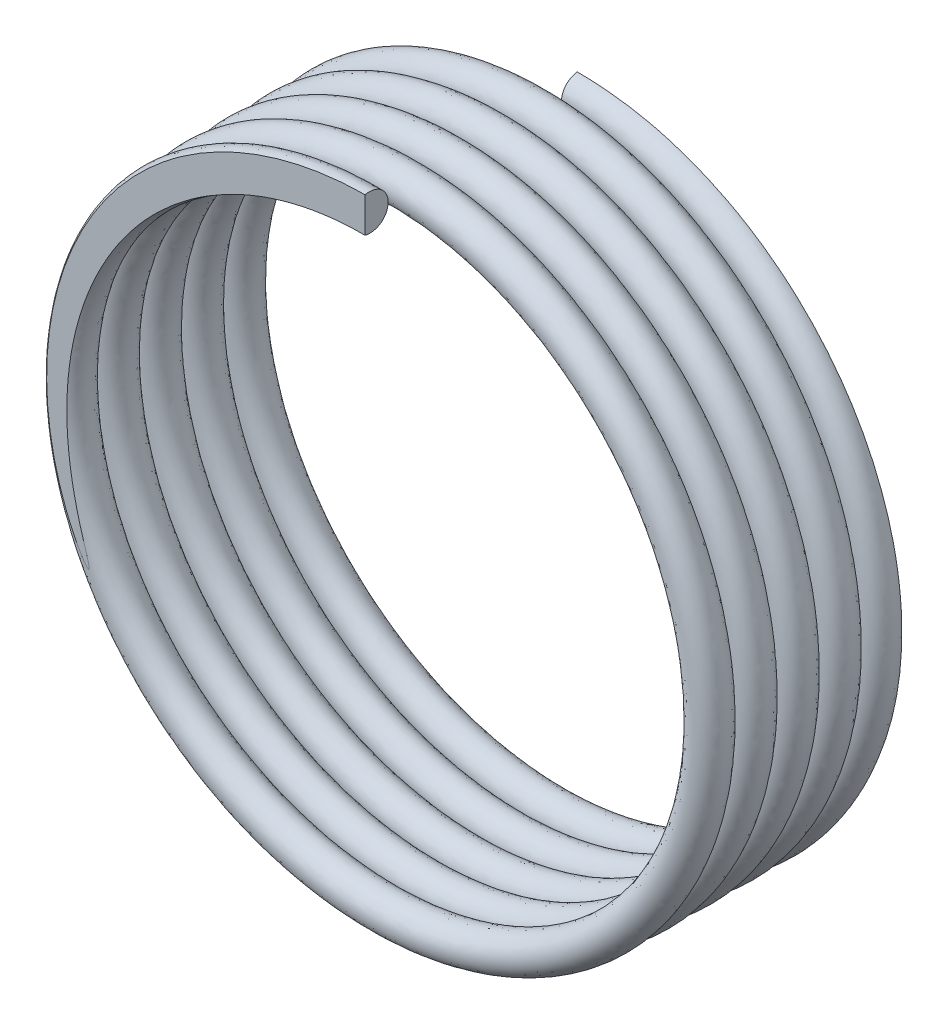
ISO-10303-21;
HEADER;
FILE_DESCRIPTION(('STEP AP214'),'2;1');
FILE_NAME('part.step','',(''),(''),'','','');
FILE_SCHEMA(('AUTOMOTIVE_DESIGN { 1 0 10303 214 1 1 1 1 }'));
ENDSEC;
DATA;
#1=APPLICATION_CONTEXT('core data for automotive mechanical design processes');
#2=APPLICATION_PROTOCOL_DEFINITION('international standard','automotive_design',2000,#1);
#3=PRODUCT_CONTEXT('',#1,'mechanical');
#4=PRODUCT('Part','Part','',(#3));
#5=PRODUCT_RELATED_PRODUCT_CATEGORY('part','',(#4));
#6=PRODUCT_DEFINITION_FORMATION('','',#4);
#7=PRODUCT_DEFINITION_CONTEXT('part definition',#1,'design');
#8=PRODUCT_DEFINITION('design','',#6,#7);
#9=PRODUCT_DEFINITION_SHAPE('','',#8);
#10=(LENGTH_UNIT() NAMED_UNIT(*) SI_UNIT(.MILLI.,.METRE.));
#11=(NAMED_UNIT(*) PLANE_ANGLE_UNIT() SI_UNIT($,.RADIAN.));
#12=(NAMED_UNIT(*) SI_UNIT($,.STERADIAN.) SOLID_ANGLE_UNIT());
#13=UNCERTAINTY_MEASURE_WITH_UNIT(LENGTH_MEASURE(1.E-05),#10,'distance_accuracy_value','');
#14=(GEOMETRIC_REPRESENTATION_CONTEXT(3) GLOBAL_UNCERTAINTY_ASSIGNED_CONTEXT((#13)) GLOBAL_UNIT_ASSIGNED_CONTEXT((#10,
#11,#12)) REPRESENTATION_CONTEXT('',''));
#15=CARTESIAN_POINT('',(0.,0.,0.));
#16=DIRECTION('',(0.,0.,1.));
#17=DIRECTION('',(1.,0.,0.));
#18=AXIS2_PLACEMENT_3D('',#15,#16,#17);
#19=CARTESIAN_POINT('',(-0.0108574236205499,8.49999999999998,0.499882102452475));
#20=DIRECTION('',(-0.99976420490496,0.,-0.021714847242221));
#21=DIRECTION('',(-0.021714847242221,0.,0.99976420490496));
#22=AXIS2_PLACEMENT_3D('',#19,#20,#21);
#23=PLANE('',#22);
#24=CARTESIAN_POINT('',(5.6058673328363E-13,8.49999999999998,0.));
#25=DIRECTION('',(0.99976420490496,0.,0.021714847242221));
#26=DIRECTION('',(0.021714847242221,0.,-0.99976420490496));
#27=AXIS2_PLACEMENT_3D('',#24,#25,#26);
#28=CIRCLE('',#27,0.500000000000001);
#29=CARTESIAN_POINT('',(-0.00162899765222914,8.99434031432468,0.0750000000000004));
#30=VERTEX_POINT('',#29);
#31=CARTESIAN_POINT('',(-0.00162899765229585,8.00565968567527,0.0750000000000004));
#32=VERTEX_POINT('',#31);
#33=EDGE_CURVE('E74',#30,#32,#28,.T.);
#34=ORIENTED_EDGE('',*,*,#33,.F.);
#35=DIRECTION('',(0.,-1.,0.));
#36=VECTOR('',#35,1.);
#37=CARTESIAN_POINT('',(-0.0016289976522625,8.49999999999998,0.0750000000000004));
#38=LINE('',#37,#36);
#39=EDGE_CURVE('E61',#30,#32,#38,.T.);
#40=ORIENTED_EDGE('',*,*,#39,.T.);
#41=EDGE_LOOP('',(#34,#40));
#42=FACE_BOUND('',#41,.T.);
#43=ADVANCED_FACE('F35',(#42),#23,.T.);
#44=CARTESIAN_POINT('',(-0.0108574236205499,8.49999999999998,6.29988210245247));
#45=DIRECTION('',(-0.99976420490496,0.,-0.021714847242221));
#46=DIRECTION('',(-0.021714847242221,0.,0.99976420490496));
#47=AXIS2_PLACEMENT_3D('',#44,#45,#46);
#48=PLANE('',#47);
#49=DIRECTION('',(0.,1.,0.));
#50=VECTOR('',#49,1.);
#51=CARTESIAN_POINT('',(-0.00271499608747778,8.49999999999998,5.925));
#52=LINE('',#51,#50);
#53=CARTESIAN_POINT('',(-0.00271499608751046,8.01588469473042,5.925));
#54=VERTEX_POINT('',#53);
#55=CARTESIAN_POINT('',(-0.00271499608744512,8.98411530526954,5.925));
#56=VERTEX_POINT('',#55);
#57=EDGE_CURVE('E54',#54,#56,#52,.T.);
#58=ORIENTED_EDGE('',*,*,#57,.F.);
#59=CARTESIAN_POINT('',(5.6058673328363E-13,8.49999999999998,5.79999999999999));
#60=DIRECTION('',(-0.99976420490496,0.,-0.0217148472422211));
#61=DIRECTION('',(-0.0217148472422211,0.,0.99976420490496));
#62=AXIS2_PLACEMENT_3D('',#59,#60,#61);
#63=CIRCLE('',#62,0.500000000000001);
#64=EDGE_CURVE('E69',#56,#54,#63,.T.);
#65=ORIENTED_EDGE('',*,*,#64,.F.);
#66=EDGE_LOOP('',(#58,#65));
#67=FACE_BOUND('',#66,.T.);
#68=ADVANCED_FACE('F37',(#67),#48,.F.);
#69=CARTESIAN_POINT('',(0.0108574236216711,8.49999999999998,-0.499882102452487));
#70=CARTESIAN_POINT('',(3.53167270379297,8.49550270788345,-0.427382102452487));
#71=CARTESIAN_POINT('',(6.01808499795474,6.00273028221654,-0.354882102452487));
#72=CARTESIAN_POINT('',(8.5044972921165,3.50995785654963,-0.282382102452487));
#73=CARTESIAN_POINT('',(8.49999999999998,-0.0108574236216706,-0.209882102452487));
#74=CARTESIAN_POINT('',(8.49550270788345,-3.53167270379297,-0.137382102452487));
#75=CARTESIAN_POINT('',(6.00273028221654,-6.01808499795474,-0.0648821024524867));
#76=CARTESIAN_POINT('',(3.50995785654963,-8.5044972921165,0.00761789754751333));
#77=CARTESIAN_POINT('',(-0.0108574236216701,-8.49999999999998,0.0801178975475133));
#78=CARTESIAN_POINT('',(-3.53167270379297,-8.49550270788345,0.152617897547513));
#79=CARTESIAN_POINT('',(-6.01808499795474,-6.00273028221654,0.225117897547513));
#80=CARTESIAN_POINT('',(-8.5044972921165,-3.50995785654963,0.297617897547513));
#81=CARTESIAN_POINT('',(-8.49999999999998,0.0108574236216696,0.370117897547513));
#82=CARTESIAN_POINT('',(-8.49550270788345,3.53167270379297,0.442617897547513));
#83=CARTESIAN_POINT('',(-6.00273028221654,6.01808499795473,0.515117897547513));
#84=CARTESIAN_POINT('',(-3.50995785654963,8.5044972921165,0.587617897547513));
#85=CARTESIAN_POINT('',(0.0108574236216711,8.49999999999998,0.660117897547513));
#86=CARTESIAN_POINT('',(3.53167270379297,8.49550270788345,0.732617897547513));
#87=CARTESIAN_POINT('',(6.01808499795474,6.00273028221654,0.805117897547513));
#88=CARTESIAN_POINT('',(8.5044972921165,3.50995785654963,0.877617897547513));
#89=CARTESIAN_POINT('',(8.49999999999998,-0.0108574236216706,0.950117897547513));
#90=CARTESIAN_POINT('',(8.49550270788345,-3.53167270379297,1.02261789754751));
#91=CARTESIAN_POINT('',(6.00273028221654,-6.01808499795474,1.09511789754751));
#92=CARTESIAN_POINT('',(3.50995785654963,-8.5044972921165,1.16761789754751));
#93=CARTESIAN_POINT('',(-0.0108574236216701,-8.49999999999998,1.24011789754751));
#94=CARTESIAN_POINT('',(-3.53167270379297,-8.49550270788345,1.31261789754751));
#95=CARTESIAN_POINT('',(-6.01808499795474,-6.00273028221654,1.38511789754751));
#96=CARTESIAN_POINT('',(-8.5044972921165,-3.50995785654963,1.45761789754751));
#97=CARTESIAN_POINT('',(-8.49999999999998,0.0108574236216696,1.53011789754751));
#98=CARTESIAN_POINT('',(-8.49550270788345,3.53167270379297,1.60261789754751));
#99=CARTESIAN_POINT('',(-6.00273028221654,6.01808499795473,1.67511789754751));
#100=CARTESIAN_POINT('',(-3.50995785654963,8.5044972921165,1.74761789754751));
#101=CARTESIAN_POINT('',(0.0108574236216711,8.49999999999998,1.82011789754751));
#102=CARTESIAN_POINT('',(3.53167270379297,8.49550270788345,1.89261789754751));
#103=CARTESIAN_POINT('',(6.01808499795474,6.00273028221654,1.96511789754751));
#104=CARTESIAN_POINT('',(8.5044972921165,3.50995785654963,2.03761789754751));
#105=CARTESIAN_POINT('',(8.49999999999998,-0.0108574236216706,2.11011789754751));
#106=CARTESIAN_POINT('',(8.49550270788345,-3.53167270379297,2.18261789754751));
#107=CARTESIAN_POINT('',(6.00273028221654,-6.01808499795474,2.25511789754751));
#108=CARTESIAN_POINT('',(3.50995785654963,-8.5044972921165,2.32761789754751));
#109=CARTESIAN_POINT('',(-0.0108574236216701,-8.49999999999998,2.40011789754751));
#110=CARTESIAN_POINT('',(-3.53167270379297,-8.49550270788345,2.47261789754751));
#111=CARTESIAN_POINT('',(-6.01808499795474,-6.00273028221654,2.54511789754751));
#112=CARTESIAN_POINT('',(-8.5044972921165,-3.50995785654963,2.61761789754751));
#113=CARTESIAN_POINT('',(-8.49999999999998,0.0108574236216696,2.69011789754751));
#114=CARTESIAN_POINT('',(-8.49550270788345,3.53167270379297,2.76261789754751));
#115=CARTESIAN_POINT('',(-6.00273028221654,6.01808499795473,2.83511789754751));
#116=CARTESIAN_POINT('',(-3.50995785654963,8.5044972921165,2.90761789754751));
#117=CARTESIAN_POINT('',(0.0108574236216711,8.49999999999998,2.98011789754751));
#118=CARTESIAN_POINT('',(3.53167270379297,8.49550270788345,3.05261789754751));
#119=CARTESIAN_POINT('',(6.01808499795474,6.00273028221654,3.12511789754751));
#120=CARTESIAN_POINT('',(8.5044972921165,3.50995785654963,3.19761789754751));
#121=CARTESIAN_POINT('',(8.49999999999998,-0.0108574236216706,3.27011789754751));
#122=CARTESIAN_POINT('',(8.49550270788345,-3.53167270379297,3.34261789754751));
#123=CARTESIAN_POINT('',(6.00273028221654,-6.01808499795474,3.41511789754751));
#124=CARTESIAN_POINT('',(3.50995785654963,-8.5044972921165,3.48761789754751));
#125=CARTESIAN_POINT('',(-0.0108574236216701,-8.49999999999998,3.56011789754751));
#126=CARTESIAN_POINT('',(-3.53167270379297,-8.49550270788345,3.63261789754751));
#127=CARTESIAN_POINT('',(-6.01808499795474,-6.00273028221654,3.70511789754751));
#128=CARTESIAN_POINT('',(-8.5044972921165,-3.50995785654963,3.77761789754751));
#129=CARTESIAN_POINT('',(-8.49999999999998,0.0108574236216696,3.85011789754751));
#130=CARTESIAN_POINT('',(-8.49550270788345,3.53167270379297,3.92261789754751));
#131=CARTESIAN_POINT('',(-6.00273028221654,6.01808499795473,3.99511789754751));
#132=CARTESIAN_POINT('',(-3.50995785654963,8.5044972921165,4.06761789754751));
#133=CARTESIAN_POINT('',(0.0108574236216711,8.49999999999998,4.14011789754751));
#134=CARTESIAN_POINT('',(3.53167270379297,8.49550270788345,4.21261789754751));
#135=CARTESIAN_POINT('',(6.01808499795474,6.00273028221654,4.28511789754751));
#136=CARTESIAN_POINT('',(8.5044972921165,3.50995785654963,4.35761789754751));
#137=CARTESIAN_POINT('',(8.49999999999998,-0.0108574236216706,4.43011789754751));
#138=CARTESIAN_POINT('',(8.49550270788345,-3.53167270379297,4.50261789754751));
#139=CARTESIAN_POINT('',(6.00273028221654,-6.01808499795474,4.57511789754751));
#140=CARTESIAN_POINT('',(3.50995785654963,-8.5044972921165,4.64761789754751));
#141=CARTESIAN_POINT('',(-0.0108574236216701,-8.49999999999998,4.72011789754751));
#142=CARTESIAN_POINT('',(-3.53167270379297,-8.49550270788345,4.79261789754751));
#143=CARTESIAN_POINT('',(-6.01808499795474,-6.00273028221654,4.86511789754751));
#144=CARTESIAN_POINT('',(-8.5044972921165,-3.50995785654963,4.93761789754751));
#145=CARTESIAN_POINT('',(-8.49999999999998,0.0108574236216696,5.01011789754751));
#146=CARTESIAN_POINT('',(-8.49550270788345,3.53167270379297,5.08261789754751));
#147=CARTESIAN_POINT('',(-6.00273028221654,6.01808499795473,5.15511789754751));
#148=CARTESIAN_POINT('',(-3.50995785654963,8.5044972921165,5.22761789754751));
#149=CARTESIAN_POINT('',(0.0108574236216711,8.49999999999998,5.30011789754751));
#150=CARTESIAN_POINT('',(0.0108574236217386,9.49999999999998,-0.499882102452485));
#151=CARTESIAN_POINT('',(3.94588626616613,9.49550270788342,-0.427382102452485));
#152=CARTESIAN_POINT('',(6.72519177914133,6.70983706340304,-0.354882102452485));
#153=CARTESIAN_POINT('',(9.50449729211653,3.92417141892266,-0.282382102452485));
#154=CARTESIAN_POINT('',(9.49999999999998,-0.010857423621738,-0.209882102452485));
#155=CARTESIAN_POINT('',(9.49550270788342,-3.94588626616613,-0.137382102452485));
#156=CARTESIAN_POINT('',(6.70983706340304,-6.72519177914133,-0.0648821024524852));
#157=CARTESIAN_POINT('',(3.92417141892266,-9.50449729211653,0.00761789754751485));
#158=CARTESIAN_POINT('',(-0.0108574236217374,-9.49999999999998,0.0801178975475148));
#159=CARTESIAN_POINT('',(-3.94588626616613,-9.49550270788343,0.152617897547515));
#160=CARTESIAN_POINT('',(-6.72519177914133,-6.70983706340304,0.225117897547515));
#161=CARTESIAN_POINT('',(-9.50449729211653,-3.92417141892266,0.297617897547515));
#162=CARTESIAN_POINT('',(-9.49999999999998,0.0108574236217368,0.370117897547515));
#163=CARTESIAN_POINT('',(-9.49550270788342,3.94588626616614,0.442617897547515));
#164=CARTESIAN_POINT('',(-6.70983706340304,6.72519177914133,0.515117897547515));
#165=CARTESIAN_POINT('',(-3.92417141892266,9.50449729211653,0.587617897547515));
#166=CARTESIAN_POINT('',(0.0108574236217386,9.49999999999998,0.660117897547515));
#167=CARTESIAN_POINT('',(3.94588626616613,9.49550270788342,0.732617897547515));
#168=CARTESIAN_POINT('',(6.72519177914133,6.70983706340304,0.805117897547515));
#169=CARTESIAN_POINT('',(9.50449729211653,3.92417141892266,0.877617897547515));
#170=CARTESIAN_POINT('',(9.49999999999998,-0.010857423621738,0.950117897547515));
#171=CARTESIAN_POINT('',(9.49550270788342,-3.94588626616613,1.02261789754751));
#172=CARTESIAN_POINT('',(6.70983706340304,-6.72519177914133,1.09511789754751));
#173=CARTESIAN_POINT('',(3.92417141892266,-9.50449729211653,1.16761789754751));
#174=CARTESIAN_POINT('',(-0.0108574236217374,-9.49999999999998,1.24011789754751));
#175=CARTESIAN_POINT('',(-3.94588626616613,-9.49550270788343,1.31261789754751));
#176=CARTESIAN_POINT('',(-6.72519177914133,-6.70983706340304,1.38511789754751));
#177=CARTESIAN_POINT('',(-9.50449729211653,-3.92417141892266,1.45761789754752));
#178=CARTESIAN_POINT('',(-9.49999999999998,0.0108574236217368,1.53011789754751));
#179=CARTESIAN_POINT('',(-9.49550270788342,3.94588626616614,1.60261789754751));
#180=CARTESIAN_POINT('',(-6.70983706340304,6.72519177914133,1.67511789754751));
#181=CARTESIAN_POINT('',(-3.92417141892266,9.50449729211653,1.74761789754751));
#182=CARTESIAN_POINT('',(0.0108574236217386,9.49999999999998,1.82011789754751));
#183=CARTESIAN_POINT('',(3.94588626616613,9.49550270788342,1.89261789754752));
#184=CARTESIAN_POINT('',(6.72519177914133,6.70983706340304,1.96511789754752));
#185=CARTESIAN_POINT('',(9.50449729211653,3.92417141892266,2.03761789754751));
#186=CARTESIAN_POINT('',(9.49999999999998,-0.010857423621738,2.11011789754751));
#187=CARTESIAN_POINT('',(9.49550270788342,-3.94588626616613,2.18261789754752));
#188=CARTESIAN_POINT('',(6.70983706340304,-6.72519177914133,2.25511789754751));
#189=CARTESIAN_POINT('',(3.92417141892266,-9.50449729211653,2.32761789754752));
#190=CARTESIAN_POINT('',(-0.0108574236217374,-9.49999999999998,2.40011789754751));
#191=CARTESIAN_POINT('',(-3.94588626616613,-9.49550270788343,2.47261789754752));
#192=CARTESIAN_POINT('',(-6.72519177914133,-6.70983706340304,2.54511789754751));
#193=CARTESIAN_POINT('',(-9.50449729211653,-3.92417141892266,2.61761789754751));
#194=CARTESIAN_POINT('',(-9.49999999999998,0.0108574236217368,2.69011789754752));
#195=CARTESIAN_POINT('',(-9.49550270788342,3.94588626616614,2.76261789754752));
#196=CARTESIAN_POINT('',(-6.70983706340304,6.72519177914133,2.83511789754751));
#197=CARTESIAN_POINT('',(-3.92417141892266,9.50449729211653,2.90761789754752));
#198=CARTESIAN_POINT('',(0.0108574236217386,9.49999999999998,2.98011789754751));
#199=CARTESIAN_POINT('',(3.94588626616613,9.49550270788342,3.05261789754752));
#200=CARTESIAN_POINT('',(6.72519177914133,6.70983706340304,3.12511789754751));
#201=CARTESIAN_POINT('',(9.50449729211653,3.92417141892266,3.19761789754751));
#202=CARTESIAN_POINT('',(9.49999999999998,-0.010857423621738,3.27011789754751));
#203=CARTESIAN_POINT('',(9.49550270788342,-3.94588626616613,3.34261789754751));
#204=CARTESIAN_POINT('',(6.70983706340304,-6.72519177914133,3.41511789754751));
#205=CARTESIAN_POINT('',(3.92417141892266,-9.50449729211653,3.48761789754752));
#206=CARTESIAN_POINT('',(-0.0108574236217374,-9.49999999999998,3.56011789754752));
#207=CARTESIAN_POINT('',(-3.94588626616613,-9.49550270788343,3.63261789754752));
#208=CARTESIAN_POINT('',(-6.72519177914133,-6.70983706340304,3.70511789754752));
#209=CARTESIAN_POINT('',(-9.50449729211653,-3.92417141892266,3.77761789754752));
#210=CARTESIAN_POINT('',(-9.49999999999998,0.0108574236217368,3.85011789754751));
#211=CARTESIAN_POINT('',(-9.49550270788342,3.94588626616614,3.92261789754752));
#212=CARTESIAN_POINT('',(-6.70983706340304,6.72519177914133,3.99511789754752));
#213=CARTESIAN_POINT('',(-3.92417141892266,9.50449729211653,4.06761789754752));
#214=CARTESIAN_POINT('',(0.0108574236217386,9.49999999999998,4.14011789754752));
#215=CARTESIAN_POINT('',(3.94588626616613,9.49550270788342,4.21261789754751));
#216=CARTESIAN_POINT('',(6.72519177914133,6.70983706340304,4.28511789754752));
#217=CARTESIAN_POINT('',(9.50449729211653,3.92417141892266,4.35761789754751));
#218=CARTESIAN_POINT('',(9.49999999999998,-0.010857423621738,4.43011789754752));
#219=CARTESIAN_POINT('',(9.49550270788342,-3.94588626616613,4.50261789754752));
#220=CARTESIAN_POINT('',(6.70983706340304,-6.72519177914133,4.57511789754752));
#221=CARTESIAN_POINT('',(3.92417141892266,-9.50449729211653,4.64761789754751));
#222=CARTESIAN_POINT('',(-0.0108574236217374,-9.49999999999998,4.72011789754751));
#223=CARTESIAN_POINT('',(-3.94588626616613,-9.49550270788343,4.79261789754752));
#224=CARTESIAN_POINT('',(-6.72519177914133,-6.70983706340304,4.86511789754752));
#225=CARTESIAN_POINT('',(-9.50449729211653,-3.92417141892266,4.93761789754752));
#226=CARTESIAN_POINT('',(-9.49999999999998,0.0108574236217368,5.01011789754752));
#227=CARTESIAN_POINT('',(-9.49550270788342,3.94588626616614,5.08261789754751));
#228=CARTESIAN_POINT('',(-6.70983706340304,6.72519177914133,5.15511789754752));
#229=CARTESIAN_POINT('',(-3.92417141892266,9.50449729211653,5.22761789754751));
#230=CARTESIAN_POINT('',(0.0108574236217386,9.49999999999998,5.30011789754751));
#231=CARTESIAN_POINT('',(-0.0108574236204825,9.49999999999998,0.499882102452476));
#232=CARTESIAN_POINT('',(3.92417141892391,9.50449729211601,0.572382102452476));
#233=CARTESIAN_POINT('',(6.70983706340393,6.72519177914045,0.644882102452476));
#234=CARTESIAN_POINT('',(9.49550270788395,3.94588626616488,0.717382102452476));
#235=CARTESIAN_POINT('',(9.49999999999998,0.0108574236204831,0.789882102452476));
#236=CARTESIAN_POINT('',(9.50449729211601,-3.92417141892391,0.862382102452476));
#237=CARTESIAN_POINT('',(6.72519177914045,-6.70983706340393,0.934882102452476));
#238=CARTESIAN_POINT('',(3.94588626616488,-9.49550270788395,1.00738210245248));
#239=CARTESIAN_POINT('',(0.0108574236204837,-9.49999999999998,1.07988210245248));
#240=CARTESIAN_POINT('',(-3.92417141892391,-9.50449729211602,1.15238210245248));
#241=CARTESIAN_POINT('',(-6.70983706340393,-6.72519177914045,1.22488210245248));
#242=CARTESIAN_POINT('',(-9.49550270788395,-3.94588626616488,1.29738210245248));
#243=CARTESIAN_POINT('',(-9.49999999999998,-0.0108574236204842,1.36988210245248));
#244=CARTESIAN_POINT('',(-9.50449729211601,3.92417141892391,1.44238210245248));
#245=CARTESIAN_POINT('',(-6.72519177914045,6.70983706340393,1.51488210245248));
#246=CARTESIAN_POINT('',(-3.94588626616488,9.49550270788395,1.58738210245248));
#247=CARTESIAN_POINT('',(-0.0108574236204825,9.49999999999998,1.65988210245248));
#248=CARTESIAN_POINT('',(3.92417141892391,9.50449729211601,1.73238210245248));
#249=CARTESIAN_POINT('',(6.70983706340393,6.72519177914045,1.80488210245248));
#250=CARTESIAN_POINT('',(9.49550270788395,3.94588626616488,1.87738210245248));
#251=CARTESIAN_POINT('',(9.49999999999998,0.0108574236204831,1.94988210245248));
#252=CARTESIAN_POINT('',(9.50449729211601,-3.92417141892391,2.02238210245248));
#253=CARTESIAN_POINT('',(6.72519177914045,-6.70983706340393,2.09488210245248));
#254=CARTESIAN_POINT('',(3.94588626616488,-9.49550270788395,2.16738210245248));
#255=CARTESIAN_POINT('',(0.0108574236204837,-9.49999999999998,2.23988210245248));
#256=CARTESIAN_POINT('',(-3.92417141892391,-9.50449729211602,2.31238210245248));
#257=CARTESIAN_POINT('',(-6.70983706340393,-6.72519177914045,2.38488210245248));
#258=CARTESIAN_POINT('',(-9.49550270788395,-3.94588626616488,2.45738210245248));
#259=CARTESIAN_POINT('',(-9.49999999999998,-0.0108574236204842,2.52988210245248));
#260=CARTESIAN_POINT('',(-9.50449729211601,3.92417141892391,2.60238210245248));
#261=CARTESIAN_POINT('',(-6.72519177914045,6.70983706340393,2.67488210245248));
#262=CARTESIAN_POINT('',(-3.94588626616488,9.49550270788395,2.74738210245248));
#263=CARTESIAN_POINT('',(-0.0108574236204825,9.49999999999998,2.81988210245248));
#264=CARTESIAN_POINT('',(3.92417141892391,9.50449729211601,2.89238210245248));
#265=CARTESIAN_POINT('',(6.70983706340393,6.72519177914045,2.96488210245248));
#266=CARTESIAN_POINT('',(9.49550270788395,3.94588626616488,3.03738210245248));
#267=CARTESIAN_POINT('',(9.49999999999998,0.0108574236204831,3.10988210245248));
#268=CARTESIAN_POINT('',(9.50449729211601,-3.92417141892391,3.18238210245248));
#269=CARTESIAN_POINT('',(6.72519177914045,-6.70983706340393,3.25488210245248));
#270=CARTESIAN_POINT('',(3.94588626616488,-9.49550270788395,3.32738210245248));
#271=CARTESIAN_POINT('',(0.0108574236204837,-9.49999999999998,3.39988210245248));
#272=CARTESIAN_POINT('',(-3.92417141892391,-9.50449729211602,3.47238210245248));
#273=CARTESIAN_POINT('',(-6.70983706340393,-6.72519177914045,3.54488210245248));
#274=CARTESIAN_POINT('',(-9.49550270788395,-3.94588626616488,3.61738210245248));
#275=CARTESIAN_POINT('',(-9.49999999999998,-0.0108574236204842,3.68988210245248));
#276=CARTESIAN_POINT('',(-9.50449729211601,3.92417141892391,3.76238210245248));
#277=CARTESIAN_POINT('',(-6.72519177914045,6.70983706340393,3.83488210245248));
#278=CARTESIAN_POINT('',(-3.94588626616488,9.49550270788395,3.90738210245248));
#279=CARTESIAN_POINT('',(-0.0108574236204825,9.49999999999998,3.97988210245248));
#280=CARTESIAN_POINT('',(3.92417141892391,9.50449729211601,4.05238210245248));
#281=CARTESIAN_POINT('',(6.70983706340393,6.72519177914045,4.12488210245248));
#282=CARTESIAN_POINT('',(9.49550270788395,3.94588626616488,4.19738210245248));
#283=CARTESIAN_POINT('',(9.49999999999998,0.0108574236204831,4.26988210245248));
#284=CARTESIAN_POINT('',(9.50449729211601,-3.92417141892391,4.34238210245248));
#285=CARTESIAN_POINT('',(6.72519177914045,-6.70983706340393,4.41488210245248));
#286=CARTESIAN_POINT('',(3.94588626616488,-9.49550270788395,4.48738210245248));
#287=CARTESIAN_POINT('',(0.0108574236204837,-9.49999999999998,4.55988210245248));
#288=CARTESIAN_POINT('',(-3.92417141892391,-9.50449729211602,4.63238210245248));
#289=CARTESIAN_POINT('',(-6.70983706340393,-6.72519177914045,4.70488210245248));
#290=CARTESIAN_POINT('',(-9.49550270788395,-3.94588626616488,4.77738210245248));
#291=CARTESIAN_POINT('',(-9.49999999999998,-0.0108574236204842,4.84988210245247));
#292=CARTESIAN_POINT('',(-9.50449729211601,3.92417141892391,4.92238210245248));
#293=CARTESIAN_POINT('',(-6.72519177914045,6.70983706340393,4.99488210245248));
#294=CARTESIAN_POINT('',(-3.94588626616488,9.49550270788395,5.06738210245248));
#295=CARTESIAN_POINT('',(-0.0108574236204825,9.49999999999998,5.13988210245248));
#296=CARTESIAN_POINT('',(3.92417141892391,9.50449729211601,5.21238210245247));
#297=CARTESIAN_POINT('',(6.70983706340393,6.72519177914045,5.28488210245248));
#298=CARTESIAN_POINT('',(9.49550270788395,3.94588626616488,5.35738210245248));
#299=CARTESIAN_POINT('',(9.49999999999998,0.0108574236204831,5.42988210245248));
#300=CARTESIAN_POINT('',(9.50449729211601,-3.92417141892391,5.50238210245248));
#301=CARTESIAN_POINT('',(6.72519177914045,-6.70983706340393,5.57488210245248));
#302=CARTESIAN_POINT('',(3.94588626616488,-9.49550270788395,5.64738210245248));
#303=CARTESIAN_POINT('',(0.0108574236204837,-9.49999999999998,5.71988210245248));
#304=CARTESIAN_POINT('',(-3.92417141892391,-9.50449729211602,5.79238210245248));
#305=CARTESIAN_POINT('',(-6.70983706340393,-6.72519177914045,5.86488210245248));
#306=CARTESIAN_POINT('',(-9.49550270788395,-3.94588626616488,5.93738210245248));
#307=CARTESIAN_POINT('',(-9.49999999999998,-0.0108574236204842,6.00988210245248));
#308=CARTESIAN_POINT('',(-9.50449729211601,3.92417141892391,6.08238210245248));
#309=CARTESIAN_POINT('',(-6.72519177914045,6.70983706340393,6.15488210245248));
#310=CARTESIAN_POINT('',(-3.94588626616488,9.49550270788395,6.22738210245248));
#311=CARTESIAN_POINT('',(-0.0108574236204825,9.49999999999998,6.29988210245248));
#312=CARTESIAN_POINT('',(-0.0108574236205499,8.49999999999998,0.499882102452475));
#313=CARTESIAN_POINT('',(3.50995785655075,8.50449729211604,0.572382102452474));
#314=CARTESIAN_POINT('',(6.00273028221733,6.01808499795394,0.644882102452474));
#315=CARTESIAN_POINT('',(8.49550270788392,3.53167270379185,0.717382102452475));
#316=CARTESIAN_POINT('',(8.49999999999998,0.0108574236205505,0.789882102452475));
#317=CARTESIAN_POINT('',(8.50449729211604,-3.50995785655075,0.862382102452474));
#318=CARTESIAN_POINT('',(6.01808499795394,-6.00273028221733,0.934882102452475));
#319=CARTESIAN_POINT('',(3.53167270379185,-8.49550270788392,1.00738210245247));
#320=CARTESIAN_POINT('',(0.010857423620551,-8.49999999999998,1.07988210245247));
#321=CARTESIAN_POINT('',(-3.50995785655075,-8.50449729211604,1.15238210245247));
#322=CARTESIAN_POINT('',(-6.00273028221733,-6.01808499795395,1.22488210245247));
#323=CARTESIAN_POINT('',(-8.49550270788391,-3.53167270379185,1.29738210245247));
#324=CARTESIAN_POINT('',(-8.49999999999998,-0.0108574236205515,1.36988210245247));
#325=CARTESIAN_POINT('',(-8.50449729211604,3.50995785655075,1.44238210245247));
#326=CARTESIAN_POINT('',(-6.01808499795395,6.00273028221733,1.51488210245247));
#327=CARTESIAN_POINT('',(-3.53167270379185,8.49550270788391,1.58738210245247));
#328=CARTESIAN_POINT('',(-0.0108574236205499,8.49999999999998,1.65988210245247));
#329=CARTESIAN_POINT('',(3.50995785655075,8.50449729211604,1.73238210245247));
#330=CARTESIAN_POINT('',(6.00273028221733,6.01808499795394,1.80488210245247));
#331=CARTESIAN_POINT('',(8.49550270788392,3.53167270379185,1.87738210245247));
#332=CARTESIAN_POINT('',(8.49999999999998,0.0108574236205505,1.94988210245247));
#333=CARTESIAN_POINT('',(8.50449729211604,-3.50995785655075,2.02238210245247));
#334=CARTESIAN_POINT('',(6.01808499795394,-6.00273028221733,2.09488210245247));
#335=CARTESIAN_POINT('',(3.53167270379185,-8.49550270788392,2.16738210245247));
#336=CARTESIAN_POINT('',(0.010857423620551,-8.49999999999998,2.23988210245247));
#337=CARTESIAN_POINT('',(-3.50995785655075,-8.50449729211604,2.31238210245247));
#338=CARTESIAN_POINT('',(-6.00273028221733,-6.01808499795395,2.38488210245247));
#339=CARTESIAN_POINT('',(-8.49550270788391,-3.53167270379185,2.45738210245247));
#340=CARTESIAN_POINT('',(-8.49999999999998,-0.0108574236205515,2.52988210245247));
#341=CARTESIAN_POINT('',(-8.50449729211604,3.50995785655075,2.60238210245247));
#342=CARTESIAN_POINT('',(-6.01808499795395,6.00273028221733,2.67488210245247));
#343=CARTESIAN_POINT('',(-3.53167270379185,8.49550270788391,2.74738210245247));
#344=CARTESIAN_POINT('',(-0.0108574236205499,8.49999999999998,2.81988210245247));
#345=CARTESIAN_POINT('',(3.50995785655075,8.50449729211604,2.89238210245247));
#346=CARTESIAN_POINT('',(6.00273028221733,6.01808499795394,2.96488210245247));
#347=CARTESIAN_POINT('',(8.49550270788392,3.53167270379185,3.03738210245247));
#348=CARTESIAN_POINT('',(8.49999999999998,0.0108574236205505,3.10988210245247));
#349=CARTESIAN_POINT('',(8.50449729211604,-3.50995785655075,3.18238210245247));
#350=CARTESIAN_POINT('',(6.01808499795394,-6.00273028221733,3.25488210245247));
#351=CARTESIAN_POINT('',(3.53167270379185,-8.49550270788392,3.32738210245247));
#352=CARTESIAN_POINT('',(0.010857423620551,-8.49999999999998,3.39988210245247));
#353=CARTESIAN_POINT('',(-3.50995785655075,-8.50449729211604,3.47238210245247));
#354=CARTESIAN_POINT('',(-6.00273028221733,-6.01808499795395,3.54488210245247));
#355=CARTESIAN_POINT('',(-8.49550270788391,-3.53167270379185,3.61738210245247));
#356=CARTESIAN_POINT('',(-8.49999999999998,-0.0108574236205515,3.68988210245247));
#357=CARTESIAN_POINT('',(-8.50449729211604,3.50995785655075,3.76238210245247));
#358=CARTESIAN_POINT('',(-6.01808499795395,6.00273028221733,3.83488210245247));
#359=CARTESIAN_POINT('',(-3.53167270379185,8.49550270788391,3.90738210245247));
#360=CARTESIAN_POINT('',(-0.0108574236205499,8.49999999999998,3.97988210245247));
#361=CARTESIAN_POINT('',(3.50995785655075,8.50449729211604,4.05238210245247));
#362=CARTESIAN_POINT('',(6.00273028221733,6.01808499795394,4.12488210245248));
#363=CARTESIAN_POINT('',(8.49550270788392,3.53167270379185,4.19738210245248));
#364=CARTESIAN_POINT('',(8.49999999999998,0.0108574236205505,4.26988210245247));
#365=CARTESIAN_POINT('',(8.50449729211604,-3.50995785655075,4.34238210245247));
#366=CARTESIAN_POINT('',(6.01808499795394,-6.00273028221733,4.41488210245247));
#367=CARTESIAN_POINT('',(3.53167270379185,-8.49550270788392,4.48738210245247));
#368=CARTESIAN_POINT('',(0.010857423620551,-8.49999999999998,4.55988210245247));
#369=CARTESIAN_POINT('',(-3.50995785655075,-8.50449729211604,4.63238210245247));
#370=CARTESIAN_POINT('',(-6.00273028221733,-6.01808499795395,4.70488210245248));
#371=CARTESIAN_POINT('',(-8.49550270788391,-3.53167270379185,4.77738210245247));
#372=CARTESIAN_POINT('',(-8.49999999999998,-0.0108574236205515,4.84988210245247));
#373=CARTESIAN_POINT('',(-8.50449729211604,3.50995785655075,4.92238210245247));
#374=CARTESIAN_POINT('',(-6.01808499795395,6.00273028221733,4.99488210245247));
#375=CARTESIAN_POINT('',(-3.53167270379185,8.49550270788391,5.06738210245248));
#376=CARTESIAN_POINT('',(-0.0108574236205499,8.49999999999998,5.13988210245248));
#377=CARTESIAN_POINT('',(3.50995785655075,8.50449729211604,5.21238210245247));
#378=CARTESIAN_POINT('',(6.00273028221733,6.01808499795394,5.28488210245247));
#379=CARTESIAN_POINT('',(8.49550270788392,3.53167270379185,5.35738210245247));
#380=CARTESIAN_POINT('',(8.49999999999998,0.0108574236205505,5.42988210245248));
#381=CARTESIAN_POINT('',(8.50449729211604,-3.50995785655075,5.50238210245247));
#382=CARTESIAN_POINT('',(6.01808499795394,-6.00273028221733,5.57488210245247));
#383=CARTESIAN_POINT('',(3.53167270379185,-8.49550270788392,5.64738210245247));
#384=CARTESIAN_POINT('',(0.010857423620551,-8.49999999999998,5.71988210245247));
#385=CARTESIAN_POINT('',(-3.50995785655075,-8.50449729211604,5.79238210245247));
#386=CARTESIAN_POINT('',(-6.00273028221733,-6.01808499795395,5.86488210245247));
#387=CARTESIAN_POINT('',(-8.49550270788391,-3.53167270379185,5.93738210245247));
#388=CARTESIAN_POINT('',(-8.49999999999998,-0.0108574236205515,6.00988210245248));
#389=CARTESIAN_POINT('',(-8.50449729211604,3.50995785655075,6.08238210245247));
#390=CARTESIAN_POINT('',(-6.01808499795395,6.00273028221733,6.15488210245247));
#391=CARTESIAN_POINT('',(-3.53167270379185,8.49550270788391,6.22738210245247));
#392=CARTESIAN_POINT('',(-0.0108574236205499,8.49999999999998,6.29988210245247));
#393=CARTESIAN_POINT('',(-0.0108574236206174,7.49999999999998,0.499882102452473));
#394=CARTESIAN_POINT('',(3.09574429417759,7.50449729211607,0.572382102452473));
#395=CARTESIAN_POINT('',(5.29562350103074,5.31097821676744,0.644882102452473));
#396=CARTESIAN_POINT('',(7.49550270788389,3.11745914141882,0.717382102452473));
#397=CARTESIAN_POINT('',(7.49999999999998,0.0108574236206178,0.789882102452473));
#398=CARTESIAN_POINT('',(7.50449729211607,-3.09574429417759,0.862382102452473));
#399=CARTESIAN_POINT('',(5.31097821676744,-5.29562350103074,0.934882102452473));
#400=CARTESIAN_POINT('',(3.11745914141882,-7.49550270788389,1.00738210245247));
#401=CARTESIAN_POINT('',(0.0108574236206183,-7.49999999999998,1.07988210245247));
#402=CARTESIAN_POINT('',(-3.09574429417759,-7.50449729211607,1.15238210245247));
#403=CARTESIAN_POINT('',(-5.29562350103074,-5.31097821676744,1.22488210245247));
#404=CARTESIAN_POINT('',(-7.49550270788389,-3.11745914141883,1.29738210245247));
#405=CARTESIAN_POINT('',(-7.49999999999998,-0.0108574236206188,1.36988210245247));
#406=CARTESIAN_POINT('',(-7.50449729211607,3.09574429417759,1.44238210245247));
#407=CARTESIAN_POINT('',(-5.31097821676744,5.29562350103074,1.51488210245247));
#408=CARTESIAN_POINT('',(-3.11745914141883,7.49550270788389,1.58738210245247));
#409=CARTESIAN_POINT('',(-0.0108574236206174,7.49999999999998,1.65988210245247));
#410=CARTESIAN_POINT('',(3.09574429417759,7.50449729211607,1.73238210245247));
#411=CARTESIAN_POINT('',(5.29562350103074,5.31097821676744,1.80488210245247));
#412=CARTESIAN_POINT('',(7.49550270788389,3.11745914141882,1.87738210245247));
#413=CARTESIAN_POINT('',(7.49999999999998,0.0108574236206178,1.94988210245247));
#414=CARTESIAN_POINT('',(7.50449729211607,-3.09574429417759,2.02238210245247));
#415=CARTESIAN_POINT('',(5.31097821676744,-5.29562350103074,2.09488210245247));
#416=CARTESIAN_POINT('',(3.11745914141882,-7.49550270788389,2.16738210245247));
#417=CARTESIAN_POINT('',(0.0108574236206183,-7.49999999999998,2.23988210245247));
#418=CARTESIAN_POINT('',(-3.09574429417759,-7.50449729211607,2.31238210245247));
#419=CARTESIAN_POINT('',(-5.29562350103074,-5.31097821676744,2.38488210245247));
#420=CARTESIAN_POINT('',(-7.49550270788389,-3.11745914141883,2.45738210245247));
#421=CARTESIAN_POINT('',(-7.49999999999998,-0.0108574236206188,2.52988210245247));
#422=CARTESIAN_POINT('',(-7.50449729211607,3.09574429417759,2.60238210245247));
#423=CARTESIAN_POINT('',(-5.31097821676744,5.29562350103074,2.67488210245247));
#424=CARTESIAN_POINT('',(-3.11745914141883,7.49550270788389,2.74738210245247));
#425=CARTESIAN_POINT('',(-0.0108574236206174,7.49999999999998,2.81988210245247));
#426=CARTESIAN_POINT('',(3.09574429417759,7.50449729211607,2.89238210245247));
#427=CARTESIAN_POINT('',(5.29562350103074,5.31097821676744,2.96488210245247));
#428=CARTESIAN_POINT('',(7.49550270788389,3.11745914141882,3.03738210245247));
#429=CARTESIAN_POINT('',(7.49999999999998,0.0108574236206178,3.10988210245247));
#430=CARTESIAN_POINT('',(7.50449729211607,-3.09574429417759,3.18238210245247));
#431=CARTESIAN_POINT('',(5.31097821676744,-5.29562350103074,3.25488210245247));
#432=CARTESIAN_POINT('',(3.11745914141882,-7.49550270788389,3.32738210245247));
#433=CARTESIAN_POINT('',(0.0108574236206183,-7.49999999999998,3.39988210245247));
#434=CARTESIAN_POINT('',(-3.09574429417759,-7.50449729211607,3.47238210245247));
#435=CARTESIAN_POINT('',(-5.29562350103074,-5.31097821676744,3.54488210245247));
#436=CARTESIAN_POINT('',(-7.49550270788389,-3.11745914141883,3.61738210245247));
#437=CARTESIAN_POINT('',(-7.49999999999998,-0.0108574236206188,3.68988210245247));
#438=CARTESIAN_POINT('',(-7.50449729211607,3.09574429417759,3.76238210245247));
#439=CARTESIAN_POINT('',(-5.31097821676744,5.29562350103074,3.83488210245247));
#440=CARTESIAN_POINT('',(-3.11745914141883,7.49550270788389,3.90738210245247));
#441=CARTESIAN_POINT('',(-0.0108574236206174,7.49999999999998,3.97988210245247));
#442=CARTESIAN_POINT('',(3.09574429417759,7.50449729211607,4.05238210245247));
#443=CARTESIAN_POINT('',(5.29562350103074,5.31097821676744,4.12488210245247));
#444=CARTESIAN_POINT('',(7.49550270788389,3.11745914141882,4.19738210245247));
#445=CARTESIAN_POINT('',(7.49999999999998,0.0108574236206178,4.26988210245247));
#446=CARTESIAN_POINT('',(7.50449729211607,-3.09574429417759,4.34238210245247));
#447=CARTESIAN_POINT('',(5.31097821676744,-5.29562350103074,4.41488210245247));
#448=CARTESIAN_POINT('',(3.11745914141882,-7.49550270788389,4.48738210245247));
#449=CARTESIAN_POINT('',(0.0108574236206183,-7.49999999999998,4.55988210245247));
#450=CARTESIAN_POINT('',(-3.09574429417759,-7.50449729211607,4.63238210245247));
#451=CARTESIAN_POINT('',(-5.29562350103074,-5.31097821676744,4.70488210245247));
#452=CARTESIAN_POINT('',(-7.49550270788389,-3.11745914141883,4.77738210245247));
#453=CARTESIAN_POINT('',(-7.49999999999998,-0.0108574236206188,4.84988210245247));
#454=CARTESIAN_POINT('',(-7.50449729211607,3.09574429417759,4.92238210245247));
#455=CARTESIAN_POINT('',(-5.31097821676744,5.29562350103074,4.99488210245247));
#456=CARTESIAN_POINT('',(-3.11745914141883,7.49550270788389,5.06738210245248));
#457=CARTESIAN_POINT('',(-0.0108574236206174,7.49999999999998,5.13988210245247));
#458=CARTESIAN_POINT('',(3.09574429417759,7.50449729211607,5.21238210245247));
#459=CARTESIAN_POINT('',(5.29562350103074,5.31097821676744,5.28488210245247));
#460=CARTESIAN_POINT('',(7.49550270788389,3.11745914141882,5.35738210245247));
#461=CARTESIAN_POINT('',(7.49999999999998,0.0108574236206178,5.42988210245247));
#462=CARTESIAN_POINT('',(7.50449729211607,-3.09574429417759,5.50238210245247));
#463=CARTESIAN_POINT('',(5.31097821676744,-5.29562350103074,5.57488210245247));
#464=CARTESIAN_POINT('',(3.11745914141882,-7.49550270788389,5.64738210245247));
#465=CARTESIAN_POINT('',(0.0108574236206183,-7.49999999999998,5.71988210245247));
#466=CARTESIAN_POINT('',(-3.09574429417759,-7.50449729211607,5.79238210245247));
#467=CARTESIAN_POINT('',(-5.29562350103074,-5.31097821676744,5.86488210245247));
#468=CARTESIAN_POINT('',(-7.49550270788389,-3.11745914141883,5.93738210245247));
#469=CARTESIAN_POINT('',(-7.49999999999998,-0.0108574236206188,6.00988210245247));
#470=CARTESIAN_POINT('',(-7.50449729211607,3.09574429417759,6.08238210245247));
#471=CARTESIAN_POINT('',(-5.31097821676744,5.29562350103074,6.15488210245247));
#472=CARTESIAN_POINT('',(-3.11745914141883,7.49550270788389,6.22738210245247));
#473=CARTESIAN_POINT('',(-0.0108574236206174,7.49999999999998,6.29988210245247));
#474=CARTESIAN_POINT('',(0.0108574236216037,7.49999999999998,-0.499882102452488));
#475=CARTESIAN_POINT('',(3.11745914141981,7.49550270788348,-0.427382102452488));
#476=CARTESIAN_POINT('',(5.31097821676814,5.29562350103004,-0.354882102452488));
#477=CARTESIAN_POINT('',(7.50449729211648,3.0957442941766,-0.282382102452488));
#478=CARTESIAN_POINT('',(7.49999999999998,-0.0108574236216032,-0.209882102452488));
#479=CARTESIAN_POINT('',(7.49550270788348,-3.11745914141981,-0.137382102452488));
#480=CARTESIAN_POINT('',(5.29562350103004,-5.31097821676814,-0.0648821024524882));
#481=CARTESIAN_POINT('',(3.0957442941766,-7.50449729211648,0.00761789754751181));
#482=CARTESIAN_POINT('',(-0.0108574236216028,-7.49999999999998,0.0801178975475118));
#483=CARTESIAN_POINT('',(-3.11745914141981,-7.49550270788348,0.152617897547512));
#484=CARTESIAN_POINT('',(-5.31097821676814,-5.29562350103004,0.225117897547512));
#485=CARTESIAN_POINT('',(-7.50449729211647,-3.0957442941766,0.297617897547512));
#486=CARTESIAN_POINT('',(-7.49999999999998,0.0108574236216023,0.370117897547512));
#487=CARTESIAN_POINT('',(-7.49550270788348,3.11745914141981,0.442617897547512));
#488=CARTESIAN_POINT('',(-5.29562350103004,5.31097821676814,0.515117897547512));
#489=CARTESIAN_POINT('',(-3.09574429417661,7.50449729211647,0.587617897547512));
#490=CARTESIAN_POINT('',(0.0108574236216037,7.49999999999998,0.660117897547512));
#491=CARTESIAN_POINT('',(3.11745914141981,7.49550270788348,0.732617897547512));
#492=CARTESIAN_POINT('',(5.31097821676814,5.29562350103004,0.805117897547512));
#493=CARTESIAN_POINT('',(7.50449729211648,3.0957442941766,0.877617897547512));
#494=CARTESIAN_POINT('',(7.49999999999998,-0.0108574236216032,0.950117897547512));
#495=CARTESIAN_POINT('',(7.49550270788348,-3.11745914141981,1.02261789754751));
#496=CARTESIAN_POINT('',(5.29562350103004,-5.31097821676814,1.09511789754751));
#497=CARTESIAN_POINT('',(3.0957442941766,-7.50449729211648,1.16761789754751));
#498=CARTESIAN_POINT('',(-0.0108574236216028,-7.49999999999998,1.24011789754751));
#499=CARTESIAN_POINT('',(-3.11745914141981,-7.49550270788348,1.31261789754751));
#500=CARTESIAN_POINT('',(-5.31097821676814,-5.29562350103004,1.38511789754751));
#501=CARTESIAN_POINT('',(-7.50449729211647,-3.0957442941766,1.45761789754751));
#502=CARTESIAN_POINT('',(-7.49999999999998,0.0108574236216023,1.53011789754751));
#503=CARTESIAN_POINT('',(-7.49550270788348,3.11745914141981,1.60261789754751));
#504=CARTESIAN_POINT('',(-5.29562350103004,5.31097821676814,1.67511789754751));
#505=CARTESIAN_POINT('',(-3.09574429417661,7.50449729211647,1.74761789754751));
#506=CARTESIAN_POINT('',(0.0108574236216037,7.49999999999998,1.82011789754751));
#507=CARTESIAN_POINT('',(3.11745914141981,7.49550270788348,1.89261789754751));
#508=CARTESIAN_POINT('',(5.31097821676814,5.29562350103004,1.96511789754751));
#509=CARTESIAN_POINT('',(7.50449729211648,3.0957442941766,2.03761789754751));
#510=CARTESIAN_POINT('',(7.49999999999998,-0.0108574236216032,2.11011789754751));
#511=CARTESIAN_POINT('',(7.49550270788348,-3.11745914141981,2.18261789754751));
#512=CARTESIAN_POINT('',(5.29562350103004,-5.31097821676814,2.25511789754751));
#513=CARTESIAN_POINT('',(3.0957442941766,-7.50449729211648,2.32761789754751));
#514=CARTESIAN_POINT('',(-0.0108574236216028,-7.49999999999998,2.40011789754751));
#515=CARTESIAN_POINT('',(-3.11745914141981,-7.49550270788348,2.47261789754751));
#516=CARTESIAN_POINT('',(-5.31097821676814,-5.29562350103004,2.54511789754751));
#517=CARTESIAN_POINT('',(-7.50449729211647,-3.0957442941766,2.61761789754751));
#518=CARTESIAN_POINT('',(-7.49999999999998,0.0108574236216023,2.69011789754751));
#519=CARTESIAN_POINT('',(-7.49550270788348,3.11745914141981,2.76261789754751));
#520=CARTESIAN_POINT('',(-5.29562350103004,5.31097821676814,2.83511789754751));
#521=CARTESIAN_POINT('',(-3.09574429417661,7.50449729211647,2.90761789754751));
#522=CARTESIAN_POINT('',(0.0108574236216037,7.49999999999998,2.98011789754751));
#523=CARTESIAN_POINT('',(3.11745914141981,7.49550270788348,3.05261789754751));
#524=CARTESIAN_POINT('',(5.31097821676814,5.29562350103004,3.12511789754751));
#525=CARTESIAN_POINT('',(7.50449729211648,3.0957442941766,3.19761789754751));
#526=CARTESIAN_POINT('',(7.49999999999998,-0.0108574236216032,3.27011789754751));
#527=CARTESIAN_POINT('',(7.49550270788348,-3.11745914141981,3.34261789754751));
#528=CARTESIAN_POINT('',(5.29562350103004,-5.31097821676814,3.41511789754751));
#529=CARTESIAN_POINT('',(3.0957442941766,-7.50449729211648,3.48761789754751));
#530=CARTESIAN_POINT('',(-0.0108574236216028,-7.49999999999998,3.56011789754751));
#531=CARTESIAN_POINT('',(-3.11745914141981,-7.49550270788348,3.63261789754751));
#532=CARTESIAN_POINT('',(-5.31097821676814,-5.29562350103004,3.70511789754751));
#533=CARTESIAN_POINT('',(-7.50449729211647,-3.0957442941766,3.77761789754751));
#534=CARTESIAN_POINT('',(-7.49999999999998,0.0108574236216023,3.85011789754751));
#535=CARTESIAN_POINT('',(-7.49550270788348,3.11745914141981,3.92261789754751));
#536=CARTESIAN_POINT('',(-5.29562350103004,5.31097821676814,3.99511789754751));
#537=CARTESIAN_POINT('',(-3.09574429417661,7.50449729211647,4.06761789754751));
#538=CARTESIAN_POINT('',(0.0108574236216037,7.49999999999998,4.14011789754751));
#539=CARTESIAN_POINT('',(3.11745914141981,7.49550270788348,4.21261789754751));
#540=CARTESIAN_POINT('',(5.31097821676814,5.29562350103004,4.28511789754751));
#541=CARTESIAN_POINT('',(7.50449729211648,3.0957442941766,4.35761789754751));
#542=CARTESIAN_POINT('',(7.49999999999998,-0.0108574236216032,4.43011789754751));
#543=CARTESIAN_POINT('',(7.49550270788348,-3.11745914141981,4.50261789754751));
#544=CARTESIAN_POINT('',(5.29562350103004,-5.31097821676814,4.57511789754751));
#545=CARTESIAN_POINT('',(3.0957442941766,-7.50449729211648,4.64761789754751));
#546=CARTESIAN_POINT('',(-0.0108574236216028,-7.49999999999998,4.72011789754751));
#547=CARTESIAN_POINT('',(-3.11745914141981,-7.49550270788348,4.79261789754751));
#548=CARTESIAN_POINT('',(-5.31097821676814,-5.29562350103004,4.86511789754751));
#549=CARTESIAN_POINT('',(-7.50449729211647,-3.0957442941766,4.93761789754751));
#550=CARTESIAN_POINT('',(-7.49999999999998,0.0108574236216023,5.01011789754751));
#551=CARTESIAN_POINT('',(-7.49550270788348,3.11745914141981,5.08261789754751));
#552=CARTESIAN_POINT('',(-5.29562350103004,5.31097821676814,5.15511789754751));
#553=CARTESIAN_POINT('',(-3.09574429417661,7.50449729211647,5.22761789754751));
#554=CARTESIAN_POINT('',(0.0108574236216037,7.49999999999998,5.30011789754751));
#555=CARTESIAN_POINT('',(0.0108574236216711,8.49999999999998,-0.499882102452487));
#556=CARTESIAN_POINT('',(3.53167270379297,8.49550270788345,-0.427382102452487));
#557=CARTESIAN_POINT('',(6.01808499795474,6.00273028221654,-0.354882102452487));
#558=CARTESIAN_POINT('',(8.5044972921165,3.50995785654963,-0.282382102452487));
#559=CARTESIAN_POINT('',(8.49999999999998,-0.0108574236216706,-0.209882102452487));
#560=CARTESIAN_POINT('',(8.49550270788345,-3.53167270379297,-0.137382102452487));
#561=CARTESIAN_POINT('',(6.00273028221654,-6.01808499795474,-0.0648821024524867));
#562=CARTESIAN_POINT('',(3.50995785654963,-8.5044972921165,0.00761789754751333));
#563=CARTESIAN_POINT('',(-0.0108574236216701,-8.49999999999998,0.0801178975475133));
#564=CARTESIAN_POINT('',(-3.53167270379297,-8.49550270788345,0.152617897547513));
#565=CARTESIAN_POINT('',(-6.01808499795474,-6.00273028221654,0.225117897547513));
#566=CARTESIAN_POINT('',(-8.5044972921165,-3.50995785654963,0.297617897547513));
#567=CARTESIAN_POINT('',(-8.49999999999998,0.0108574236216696,0.370117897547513));
#568=CARTESIAN_POINT('',(-8.49550270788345,3.53167270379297,0.442617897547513));
#569=CARTESIAN_POINT('',(-6.00273028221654,6.01808499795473,0.515117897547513));
#570=CARTESIAN_POINT('',(-3.50995785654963,8.5044972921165,0.587617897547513));
#571=CARTESIAN_POINT('',(0.0108574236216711,8.49999999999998,0.660117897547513));
#572=CARTESIAN_POINT('',(3.53167270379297,8.49550270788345,0.732617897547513));
#573=CARTESIAN_POINT('',(6.01808499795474,6.00273028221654,0.805117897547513));
#574=CARTESIAN_POINT('',(8.5044972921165,3.50995785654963,0.877617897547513));
#575=CARTESIAN_POINT('',(8.49999999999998,-0.0108574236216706,0.950117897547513));
#576=CARTESIAN_POINT('',(8.49550270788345,-3.53167270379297,1.02261789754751));
#577=CARTESIAN_POINT('',(6.00273028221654,-6.01808499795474,1.09511789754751));
#578=CARTESIAN_POINT('',(3.50995785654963,-8.5044972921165,1.16761789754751));
#579=CARTESIAN_POINT('',(-0.0108574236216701,-8.49999999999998,1.24011789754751));
#580=CARTESIAN_POINT('',(-3.53167270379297,-8.49550270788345,1.31261789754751));
#581=CARTESIAN_POINT('',(-6.01808499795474,-6.00273028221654,1.38511789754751));
#582=CARTESIAN_POINT('',(-8.5044972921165,-3.50995785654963,1.45761789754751));
#583=CARTESIAN_POINT('',(-8.49999999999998,0.0108574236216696,1.53011789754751));
#584=CARTESIAN_POINT('',(-8.49550270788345,3.53167270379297,1.60261789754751));
#585=CARTESIAN_POINT('',(-6.00273028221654,6.01808499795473,1.67511789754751));
#586=CARTESIAN_POINT('',(-3.50995785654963,8.5044972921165,1.74761789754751));
#587=CARTESIAN_POINT('',(0.0108574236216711,8.49999999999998,1.82011789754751));
#588=CARTESIAN_POINT('',(3.53167270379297,8.49550270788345,1.89261789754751));
#589=CARTESIAN_POINT('',(6.01808499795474,6.00273028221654,1.96511789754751));
#590=CARTESIAN_POINT('',(8.5044972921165,3.50995785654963,2.03761789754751));
#591=CARTESIAN_POINT('',(8.49999999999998,-0.0108574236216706,2.11011789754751));
#592=CARTESIAN_POINT('',(8.49550270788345,-3.53167270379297,2.18261789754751));
#593=CARTESIAN_POINT('',(6.00273028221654,-6.01808499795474,2.25511789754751));
#594=CARTESIAN_POINT('',(3.50995785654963,-8.5044972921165,2.32761789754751));
#595=CARTESIAN_POINT('',(-0.0108574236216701,-8.49999999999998,2.40011789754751));
#596=CARTESIAN_POINT('',(-3.53167270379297,-8.49550270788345,2.47261789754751));
#597=CARTESIAN_POINT('',(-6.01808499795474,-6.00273028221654,2.54511789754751));
#598=CARTESIAN_POINT('',(-8.5044972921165,-3.50995785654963,2.61761789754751));
#599=CARTESIAN_POINT('',(-8.49999999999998,0.0108574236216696,2.69011789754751));
#600=CARTESIAN_POINT('',(-8.49550270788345,3.53167270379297,2.76261789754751));
#601=CARTESIAN_POINT('',(-6.00273028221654,6.01808499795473,2.83511789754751));
#602=CARTESIAN_POINT('',(-3.50995785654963,8.5044972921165,2.90761789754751));
#603=CARTESIAN_POINT('',(0.0108574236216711,8.49999999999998,2.98011789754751));
#604=CARTESIAN_POINT('',(3.53167270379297,8.49550270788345,3.05261789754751));
#605=CARTESIAN_POINT('',(6.01808499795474,6.00273028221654,3.12511789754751));
#606=CARTESIAN_POINT('',(8.5044972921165,3.50995785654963,3.19761789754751));
#607=CARTESIAN_POINT('',(8.49999999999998,-0.0108574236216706,3.27011789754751));
#608=CARTESIAN_POINT('',(8.49550270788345,-3.53167270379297,3.34261789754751));
#609=CARTESIAN_POINT('',(6.00273028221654,-6.01808499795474,3.41511789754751));
#610=CARTESIAN_POINT('',(3.50995785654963,-8.5044972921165,3.48761789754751));
#611=CARTESIAN_POINT('',(-0.0108574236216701,-8.49999999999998,3.56011789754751));
#612=CARTESIAN_POINT('',(-3.53167270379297,-8.49550270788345,3.63261789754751));
#613=CARTESIAN_POINT('',(-6.01808499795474,-6.00273028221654,3.70511789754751));
#614=CARTESIAN_POINT('',(-8.5044972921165,-3.50995785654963,3.77761789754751));
#615=CARTESIAN_POINT('',(-8.49999999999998,0.0108574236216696,3.85011789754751));
#616=CARTESIAN_POINT('',(-8.49550270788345,3.53167270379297,3.92261789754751));
#617=CARTESIAN_POINT('',(-6.00273028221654,6.01808499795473,3.99511789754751));
#618=CARTESIAN_POINT('',(-3.50995785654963,8.5044972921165,4.06761789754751));
#619=CARTESIAN_POINT('',(0.0108574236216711,8.49999999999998,4.14011789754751));
#620=CARTESIAN_POINT('',(3.53167270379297,8.49550270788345,4.21261789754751));
#621=CARTESIAN_POINT('',(6.01808499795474,6.00273028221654,4.28511789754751));
#622=CARTESIAN_POINT('',(8.5044972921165,3.50995785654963,4.35761789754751));
#623=CARTESIAN_POINT('',(8.49999999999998,-0.0108574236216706,4.43011789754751));
#624=CARTESIAN_POINT('',(8.49550270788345,-3.53167270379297,4.50261789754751));
#625=CARTESIAN_POINT('',(6.00273028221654,-6.01808499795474,4.57511789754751));
#626=CARTESIAN_POINT('',(3.50995785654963,-8.5044972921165,4.64761789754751));
#627=CARTESIAN_POINT('',(-0.0108574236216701,-8.49999999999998,4.72011789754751));
#628=CARTESIAN_POINT('',(-3.53167270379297,-8.49550270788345,4.79261789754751));
#629=CARTESIAN_POINT('',(-6.01808499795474,-6.00273028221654,4.86511789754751));
#630=CARTESIAN_POINT('',(-8.5044972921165,-3.50995785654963,4.93761789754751));
#631=CARTESIAN_POINT('',(-8.49999999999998,0.0108574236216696,5.01011789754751));
#632=CARTESIAN_POINT('',(-8.49550270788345,3.53167270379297,5.08261789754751));
#633=CARTESIAN_POINT('',(-6.00273028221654,6.01808499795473,5.15511789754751));
#634=CARTESIAN_POINT('',(-3.50995785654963,8.5044972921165,5.22761789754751));
#635=CARTESIAN_POINT('',(0.0108574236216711,8.49999999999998,5.30011789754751));
#636=(BOUNDED_SURFACE() B_SPLINE_SURFACE(3,2,((#69,#70,#71,#72,#73,#74,#75,#76,#77,#78,#79,#80,
#81,#82,#83,#84,#85,#86,#87,#88,#89,#90,#91,#92,#93,#94,#95,#96,#97,#98,#99,#100,#101,#102,#103,
#104,#105,#106,#107,#108,#109,#110,#111,#112,#113,#114,#115,#116,#117,#118,#119,#120,#121,#122,
#123,#124,#125,#126,#127,#128,#129,#130,#131,#132,#133,#134,#135,#136,#137,#138,#139,#140,#141,
#142,#143,#144,#145,#146,#147,#148,#149),(#150,#151,#152,#153,#154,#155,#156,#157,#158,#159,
#160,#161,#162,#163,#164,#165,#166,#167,#168,#169,#170,#171,#172,#173,#174,#175,#176,#177,#178,
#179,#180,#181,#182,#183,#184,#185,#186,#187,#188,#189,#190,#191,#192,#193,#194,#195,#196,#197,
#198,#199,#200,#201,#202,#203,#204,#205,#206,#207,#208,#209,#210,#211,#212,#213,#214,#215,#216,
#217,#218,#219,#220,#221,#222,#223,#224,#225,#226,#227,#228,#229,#230),(#231,#232,#233,#234,
#235,#236,#237,#238,#239,#240,#241,#242,#243,#244,#245,#246,#247,#248,#249,#250,#251,#252,#253,
#254,#255,#256,#257,#258,#259,#260,#261,#262,#263,#264,#265,#266,#267,#268,#269,#270,#271,#272,
#273,#274,#275,#276,#277,#278,#279,#280,#281,#282,#283,#284,#285,#286,#287,#288,#289,#290,#291,
#292,#293,#294,#295,#296,#297,#298,#299,#300,#301,#302,#303,#304,#305,#306,#307,#308,#309,#310,
#311),(#312,#313,#314,#315,#316,#317,#318,#319,#320,#321,#322,#323,#324,#325,#326,#327,#328,
#329,#330,#331,#332,#333,#334,#335,#336,#337,#338,#339,#340,#341,#342,#343,#344,#345,#346,#347,
#348,#349,#350,#351,#352,#353,#354,#355,#356,#357,#358,#359,#360,#361,#362,#363,#364,#365,#366,
#367,#368,#369,#370,#371,#372,#373,#374,#375,#376,#377,#378,#379,#380,#381,#382,#383,#384,#385,
#386,#387,#388,#389,#390,#391,#392),(#393,#394,#395,#396,#397,#398,#399,#400,#401,#402,#403,
#404,#405,#406,#407,#408,#409,#410,#411,#412,#413,#414,#415,#416,#417,#418,#419,#420,#421,#422,
#423,#424,#425,#426,#427,#428,#429,#430,#431,#432,#433,#434,#435,#436,#437,#438,#439,#440,#441,
#442,#443,#444,#445,#446,#447,#448,#449,#450,#451,#452,#453,#454,#455,#456,#457,#458,#459,#460,
#461,#462,#463,#464,#465,#466,#467,#468,#469,#470,#471,#472,#473),(#474,#475,#476,#477,#478,
#479,#480,#481,#482,#483,#484,#485,#486,#487,#488,#489,#490,#491,#492,#493,#494,#495,#496,#497,
#498,#499,#500,#501,#502,#503,#504,#505,#506,#507,#508,#509,#510,#511,#512,#513,#514,#515,#516,
#517,#518,#519,#520,#521,#522,#523,#524,#525,#526,#527,#528,#529,#530,#531,#532,#533,#534,#535,
#536,#537,#538,#539,#540,#541,#542,#543,#544,#545,#546,#547,#548,#549,#550,#551,#552,#553,#554),
(#555,#556,#557,#558,#559,#560,#561,#562,#563,#564,#565,#566,#567,#568,#569,#570,#571,#572,#573,
#574,#575,#576,#577,#578,#579,#580,#581,#582,#583,#584,#585,#586,#587,#588,#589,#590,#591,#592,
#593,#594,#595,#596,#597,#598,#599,#600,#601,#602,#603,#604,#605,#606,#607,#608,#609,#610,#611,
#612,#613,#614,#615,#616,#617,#618,#619,#620,#621,#622,#623,#624,#625,#626,#627,#628,#629,#630,
#631,#632,#633,#634,#635)),.UNSPECIFIED.,.T.,.F.,.F.) B_SPLINE_SURFACE_WITH_KNOTS((4,3,4),(3,2,
2,2,2,2,2,2,2,2,2,2,2,2,2,2,2,2,2,2,2,2,2,2,2,2,2,2,2,2,2,2,2,2,2,2,2,2,2,2,3),(0.,0.5,1.),(0.,
0.025,0.05,0.075,0.1,0.125,0.15,0.175,0.2,0.225,0.25,0.275,0.3,0.325,0.35,0.375,0.4,0.425,0.45,
0.475,0.5,0.525,0.55,0.575,0.6,0.625,0.65,0.675,0.7,0.725,0.75,0.775,0.8,0.825,0.85,0.875,0.9,
0.925,0.95,0.975,1.),
.UNSPECIFIED.) GEOMETRIC_REPRESENTATION_ITEM() RATIONAL_B_SPLINE_SURFACE(((1.,0.923879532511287,
1.,0.923879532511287,1.,0.923879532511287,1.,0.923879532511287,1.,0.923879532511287,1.,
0.923879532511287,1.,0.923879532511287,1.,0.923879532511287,1.,0.923879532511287,1.,
0.923879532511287,1.,0.923879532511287,1.,0.923879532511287,1.,0.923879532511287,1.,
0.923879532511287,1.,0.923879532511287,1.,0.923879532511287,1.,0.923879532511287,1.,
0.923879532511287,1.,0.923879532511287,1.,0.923879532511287,1.,0.923879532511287,1.,
0.923879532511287,1.,0.923879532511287,1.,0.923879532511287,1.,0.923879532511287,1.,
0.923879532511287,1.,0.923879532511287,1.,0.923879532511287,1.,0.923879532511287,1.,
0.923879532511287,1.,0.923879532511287,1.,0.923879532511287,1.,0.923879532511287,1.,
0.923879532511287,1.,0.923879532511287,1.,0.923879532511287,1.,0.923879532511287,1.,
0.923879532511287,1.,0.923879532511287,1.,0.923879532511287,1.),(0.333333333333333,
0.307959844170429,0.333333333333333,0.307959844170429,0.333333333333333,0.307959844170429,
0.333333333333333,0.307959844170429,0.333333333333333,0.307959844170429,0.333333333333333,
0.307959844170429,0.333333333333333,0.307959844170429,0.333333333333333,0.307959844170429,
0.333333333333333,0.307959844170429,0.333333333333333,0.307959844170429,0.333333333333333,
0.307959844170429,0.333333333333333,0.307959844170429,0.333333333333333,0.307959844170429,
0.333333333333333,0.307959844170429,0.333333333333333,0.307959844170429,0.333333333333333,
0.307959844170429,0.333333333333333,0.307959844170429,0.333333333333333,0.307959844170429,
0.333333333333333,0.307959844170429,0.333333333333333,0.307959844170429,0.333333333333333,
0.307959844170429,0.333333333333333,0.307959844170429,0.333333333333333,0.307959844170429,
0.333333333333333,0.307959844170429,0.333333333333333,0.307959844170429,0.333333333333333,
0.307959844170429,0.333333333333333,0.307959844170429,0.333333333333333,0.307959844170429,
0.333333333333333,0.307959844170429,0.333333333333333,0.307959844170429,0.333333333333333,
0.307959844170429,0.333333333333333,0.307959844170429,0.333333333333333,0.307959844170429,
0.333333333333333,0.307959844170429,0.333333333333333,0.307959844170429,0.333333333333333,
0.307959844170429,0.333333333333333,0.307959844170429,0.333333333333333,0.307959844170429,
0.333333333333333,0.307959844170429,0.333333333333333,0.307959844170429,0.333333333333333),
(0.333333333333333,0.307959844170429,0.333333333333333,0.307959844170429,0.333333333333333,
0.307959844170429,0.333333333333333,0.307959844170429,0.333333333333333,0.307959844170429,
0.333333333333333,0.307959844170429,0.333333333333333,0.307959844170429,0.333333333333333,
0.307959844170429,0.333333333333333,0.307959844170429,0.333333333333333,0.307959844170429,
0.333333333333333,0.307959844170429,0.333333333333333,0.307959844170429,0.333333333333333,
0.307959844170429,0.333333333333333,0.307959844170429,0.333333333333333,0.307959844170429,
0.333333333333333,0.307959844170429,0.333333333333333,0.307959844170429,0.333333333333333,
0.307959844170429,0.333333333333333,0.307959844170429,0.333333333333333,0.307959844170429,
0.333333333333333,0.307959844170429,0.333333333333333,0.307959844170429,0.333333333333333,
0.307959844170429,0.333333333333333,0.307959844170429,0.333333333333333,0.307959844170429,
0.333333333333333,0.307959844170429,0.333333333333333,0.307959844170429,0.333333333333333,
0.307959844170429,0.333333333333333,0.307959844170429,0.333333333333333,0.307959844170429,
0.333333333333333,0.307959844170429,0.333333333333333,0.307959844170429,0.333333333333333,
0.307959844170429,0.333333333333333,0.307959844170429,0.333333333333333,0.307959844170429,
0.333333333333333,0.307959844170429,0.333333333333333,0.307959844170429,0.333333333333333,
0.307959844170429,0.333333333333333,0.307959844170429,0.333333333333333,0.307959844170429,
0.333333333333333),(1.,0.923879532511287,1.,0.923879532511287,1.,0.923879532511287,1.,
0.923879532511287,1.,0.923879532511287,1.,0.923879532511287,1.,0.923879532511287,1.,
0.923879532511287,1.,0.923879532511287,1.,0.923879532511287,1.,0.923879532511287,1.,
0.923879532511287,1.,0.923879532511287,1.,0.923879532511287,1.,0.923879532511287,1.,
0.923879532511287,1.,0.923879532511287,1.,0.923879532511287,1.,0.923879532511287,1.,
0.923879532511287,1.,0.923879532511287,1.,0.923879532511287,1.,0.923879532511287,1.,
0.923879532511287,1.,0.923879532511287,1.,0.923879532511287,1.,0.923879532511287,1.,
0.923879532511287,1.,0.923879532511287,1.,0.923879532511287,1.,0.923879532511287,1.,
0.923879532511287,1.,0.923879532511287,1.,0.923879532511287,1.,0.923879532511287,1.,
0.923879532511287,1.,0.923879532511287,1.,0.923879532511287,1.,0.923879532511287,1.,
0.923879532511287,1.),(0.333333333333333,0.307959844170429,0.333333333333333,0.307959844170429,
0.333333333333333,0.307959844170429,0.333333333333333,0.307959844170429,0.333333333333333,
0.307959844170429,0.333333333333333,0.307959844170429,0.333333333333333,0.307959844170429,
0.333333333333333,0.307959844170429,0.333333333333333,0.307959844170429,0.333333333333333,
0.307959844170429,0.333333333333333,0.307959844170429,0.333333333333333,0.307959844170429,
0.333333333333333,0.307959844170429,0.333333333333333,0.307959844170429,0.333333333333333,
0.307959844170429,0.333333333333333,0.307959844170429,0.333333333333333,0.307959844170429,
0.333333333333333,0.307959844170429,0.333333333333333,0.307959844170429,0.333333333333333,
0.307959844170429,0.333333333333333,0.307959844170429,0.333333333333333,0.307959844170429,
0.333333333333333,0.307959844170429,0.333333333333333,0.307959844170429,0.333333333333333,
0.307959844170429,0.333333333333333,0.307959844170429,0.333333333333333,0.307959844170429,
0.333333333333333,0.307959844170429,0.333333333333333,0.307959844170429,0.333333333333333,
0.307959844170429,0.333333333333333,0.307959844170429,0.333333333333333,0.307959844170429,
0.333333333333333,0.307959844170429,0.333333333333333,0.307959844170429,0.333333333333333,
0.307959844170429,0.333333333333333,0.307959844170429,0.333333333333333,0.307959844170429,
0.333333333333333,0.307959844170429,0.333333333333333,0.307959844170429,0.333333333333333,
0.307959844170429,0.333333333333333),(0.333333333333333,0.307959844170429,0.333333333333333,
0.307959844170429,0.333333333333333,0.307959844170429,0.333333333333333,0.307959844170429,
0.333333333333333,0.307959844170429,0.333333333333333,0.307959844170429,0.333333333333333,
0.307959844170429,0.333333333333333,0.307959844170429,0.333333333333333,0.307959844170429,
0.333333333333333,0.307959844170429,0.333333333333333,0.307959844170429,0.333333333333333,
0.307959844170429,0.333333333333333,0.307959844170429,0.333333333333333,0.307959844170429,
0.333333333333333,0.307959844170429,0.333333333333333,0.307959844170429,0.333333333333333,
0.307959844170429,0.333333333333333,0.307959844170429,0.333333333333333,0.307959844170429,
0.333333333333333,0.307959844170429,0.333333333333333,0.307959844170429,0.333333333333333,
0.307959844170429,0.333333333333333,0.307959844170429,0.333333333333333,0.307959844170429,
0.333333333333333,0.307959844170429,0.333333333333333,0.307959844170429,0.333333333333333,
0.307959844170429,0.333333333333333,0.307959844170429,0.333333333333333,0.307959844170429,
0.333333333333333,0.307959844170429,0.333333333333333,0.307959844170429,0.333333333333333,
0.307959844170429,0.333333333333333,0.307959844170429,0.333333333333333,0.307959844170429,
0.333333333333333,0.307959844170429,0.333333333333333,0.307959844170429,0.333333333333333,
0.307959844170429,0.333333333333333,0.307959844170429,0.333333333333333,0.307959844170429,
0.333333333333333,0.307959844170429,0.333333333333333),(1.,0.923879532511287,1.,
0.923879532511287,1.,0.923879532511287,1.,0.923879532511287,1.,0.923879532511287,1.,
0.923879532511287,1.,0.923879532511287,1.,0.923879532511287,1.,0.923879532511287,1.,
0.923879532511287,1.,0.923879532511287,1.,0.923879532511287,1.,0.923879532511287,1.,
0.923879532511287,1.,0.923879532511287,1.,0.923879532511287,1.,0.923879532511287,1.,
0.923879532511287,1.,0.923879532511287,1.,0.923879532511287,1.,0.923879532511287,1.,
0.923879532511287,1.,0.923879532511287,1.,0.923879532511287,1.,0.923879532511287,1.,
0.923879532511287,1.,0.923879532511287,1.,0.923879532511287,1.,0.923879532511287,1.,
0.923879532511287,1.,0.923879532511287,1.,0.923879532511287,1.,0.923879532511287,1.,
0.923879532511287,1.,0.923879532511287,1.,0.923879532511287,1.,0.923879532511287,1.,
0.923879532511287,1.,0.923879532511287,1.,0.923879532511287,1.))) REPRESENTATION_ITEM('') SURFACE());
#637=CARTESIAN_POINT('',(-0.00271499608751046,8.01588469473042,5.925));
#638=CARTESIAN_POINT('',(-0.169666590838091,8.01677418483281,5.92500000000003));
#639=CARTESIAN_POINT('',(-0.336629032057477,8.01249402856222,5.92500000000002));
#640=CARTESIAN_POINT('',(-0.670269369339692,7.99362598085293,5.92499999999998));
#641=CARTESIAN_POINT('',(-0.836946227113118,7.97901972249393,5.92499999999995));
#642=CARTESIAN_POINT('',(-1.22963670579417,7.93233195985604,5.92499999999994));
#643=CARTESIAN_POINT('',(-1.4551373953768,7.8958217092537,5.92499999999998));
#644=CARTESIAN_POINT('',(-1.90234664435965,7.80392713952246,5.92500000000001));
#645=CARTESIAN_POINT('',(-2.12405348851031,7.74853450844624,5.925));
#646=CARTESIAN_POINT('',(-2.56226045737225,7.61921419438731,5.925));
#647=CARTESIAN_POINT('',(-2.77875465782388,7.54526642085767,5.925));
#648=CARTESIAN_POINT('',(-3.20474680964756,7.37940302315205,5.925));
#649=CARTESIAN_POINT('',(-3.41424471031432,7.28748726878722,5.925));
#650=CARTESIAN_POINT('',(-3.8247238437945,7.08636521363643,5.925));
#651=CARTESIAN_POINT('',(-4.02570664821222,6.97716212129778,5.925));
#652=CARTESIAN_POINT('',(-4.41772532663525,6.74226347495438,5.925));
#653=CARTESIAN_POINT('',(-4.60876325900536,6.61657135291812,5.925));
#654=CARTESIAN_POINT('',(-4.97950646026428,6.34961656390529,5.925));
#655=CARTESIAN_POINT('',(-5.15921799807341,6.20836263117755,5.925));
#656=CARTESIAN_POINT('',(-5.41944155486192,5.98549880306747,5.925));
#657=CARTESIAN_POINT('',(-5.50467130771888,5.90933387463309,5.925));
#658=CARTESIAN_POINT('',(-5.67184408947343,5.75347827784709,5.925));
#659=CARTESIAN_POINT('',(-5.75378710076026,5.67378759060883,5.925));
#660=CARTESIAN_POINT('',(-5.99469722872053,5.42953653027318,5.925));
#661=CARTESIAN_POINT('',(-6.14859851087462,5.25992322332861,5.925));
#662=CARTESIAN_POINT('',(-6.44175683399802,4.90851673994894,5.925));
#663=CARTESIAN_POINT('',(-6.58101377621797,4.72672348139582,5.925));
#664=CARTESIAN_POINT('',(-6.84402505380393,4.35216137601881,5.925));
#665=CARTESIAN_POINT('',(-6.96777484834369,4.15938933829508,5.925));
#666=CARTESIAN_POINT('',(-7.19885565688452,3.76436011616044,5.925));
#667=CARTESIAN_POINT('',(-7.30619368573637,3.56210703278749,5.925));
#668=CARTESIAN_POINT('',(-7.50545871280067,3.14603198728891,5.925));
#669=CARTESIAN_POINT('',(-7.59710240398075,2.9320742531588,5.925));
#670=CARTESIAN_POINT('',(-7.76210851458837,2.4974626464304,5.925));
#671=CARTESIAN_POINT('',(-7.83548795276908,2.27681522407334,5.925));
#672=CARTESIAN_POINT('',(-7.9636838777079,1.82995817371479,5.925));
#673=CARTESIAN_POINT('',(-8.01848447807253,1.6037439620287,5.925));
#674=CARTESIAN_POINT('',(-8.08645384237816,1.26165105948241,5.925));
#675=CARTESIAN_POINT('',(-8.10674024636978,1.14714168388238,5.925));
#676=CARTESIAN_POINT('',(-8.1425517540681,0.91734831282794,5.925));
#677=CARTESIAN_POINT('',(-8.1580758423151,0.802064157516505,5.92499999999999));
#678=CARTESIAN_POINT('',(-8.18447575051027,0.569792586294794,5.92499999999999));
#679=CARTESIAN_POINT('',(-8.1953032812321,0.452799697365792,5.925));
#680=CARTESIAN_POINT('',(-8.212051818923,0.218452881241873,5.925));
#681=CARTESIAN_POINT('',(-8.21797237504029,0.101098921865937,5.925));
#682=CARTESIAN_POINT('',(-8.2249972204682,-0.133757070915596,5.925));
#683=CARTESIAN_POINT('',(-8.2261013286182,-0.251259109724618,5.925));
#684=CARTESIAN_POINT('',(-8.22361015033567,-0.486203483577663,5.925));
#685=CARTESIAN_POINT('',(-8.22001497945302,-0.603645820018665,5.925));
#686=CARTESIAN_POINT('',(-8.20224262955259,-0.955345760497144,5.925));
#687=CARTESIAN_POINT('',(-8.18108751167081,-1.18928440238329,5.925));
#688=CARTESIAN_POINT('',(-8.12086062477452,-1.65471673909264,5.925));
#689=CARTESIAN_POINT('',(-8.08179655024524,-1.88621144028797,5.925));
#690=CARTESIAN_POINT('',(-8.01759820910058,-2.19797405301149,5.925));
#691=CARTESIAN_POINT('',(-7.99965581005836,-2.27977868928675,5.925));
#692=CARTESIAN_POINT('',(-7.97128670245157,-2.40200594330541,5.925));
#693=CARTESIAN_POINT('',(-7.9616051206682,-2.44260102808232,5.925));
#694=CARTESIAN_POINT('',(-7.94176874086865,-2.52366811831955,5.925));
#695=CARTESIAN_POINT('',(-7.93161402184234,-2.56414014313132,5.925));
#696=CARTESIAN_POINT('',(-7.91309721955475,-2.63622755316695,5.925));
#697=CARTESIAN_POINT('',(-7.904822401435,-2.66786539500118,5.925));
#698=CARTESIAN_POINT('',(-7.88800617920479,-2.73107736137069,5.925));
#699=CARTESIAN_POINT('',(-7.87946471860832,-2.76265147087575,5.925));
#700=CARTESIAN_POINT('',(-7.86212538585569,-2.82575878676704,5.925));
#701=CARTESIAN_POINT('',(-7.85332729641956,-2.85729193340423,5.925));
#702=CARTESIAN_POINT('',(-7.83538057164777,-2.92072268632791,5.925));
#703=CARTESIAN_POINT('',(-7.8262287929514,-2.952619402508,5.92499999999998));
#704=CARTESIAN_POINT('',(-7.80772571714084,-3.01632279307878,5.92500000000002));
#705=CARTESIAN_POINT('',(-7.79837461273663,-3.04812952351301,5.92500000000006));
#706=CARTESIAN_POINT('',(-7.77953425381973,-3.11158058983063,5.92499999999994));
#707=CARTESIAN_POINT('',(-7.77004559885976,-3.14322510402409,5.92499999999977));
#708=CARTESIAN_POINT('',(-7.75084196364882,-3.20683349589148,5.92499999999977));
#709=CARTESIAN_POINT('',(-7.74112563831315,-3.23879696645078,5.92499999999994));
#710=CARTESIAN_POINT('',(-7.72161329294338,-3.30282588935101,5.92500000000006));
#711=CARTESIAN_POINT('',(-7.71181711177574,-3.33489129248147,5.92500000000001));
#712=CARTESIAN_POINT('',(-7.69712394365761,-3.38322267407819,5.92499999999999));
#713=CARTESIAN_POINT('',(-7.69219429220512,-3.39947870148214,5.925));
#714=CARTESIAN_POINT('',(-7.68238239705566,-3.43201507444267,5.925));
#715=CARTESIAN_POINT('',(-7.67750018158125,-3.44829542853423,5.925));
#716=CARTESIAN_POINT('',(-7.6679715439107,-3.48038509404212,5.925));
#717=CARTESIAN_POINT('',(-7.66332247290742,-3.49619361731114,5.925));
#718=CARTESIAN_POINT('',(-7.65416824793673,-3.52781785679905,5.925));
#719=CARTESIAN_POINT('',(-7.64966282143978,-3.54363349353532,5.925));
#720=CARTESIAN_POINT('',(-7.64092847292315,-3.57511951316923,5.925));
#721=CARTESIAN_POINT('',(-7.63669671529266,-3.59078910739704,5.925));
#722=CARTESIAN_POINT('',(-7.62855582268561,-3.62233559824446,5.925));
#723=CARTESIAN_POINT('',(-7.62464924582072,-3.63821317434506,5.925));
#724=CARTESIAN_POINT('',(-7.61935691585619,-3.66192101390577,5.925));
#725=CARTESIAN_POINT('',(-7.61770780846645,-3.66969143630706,5.925));
#726=CARTESIAN_POINT('',(-7.61465310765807,-3.68530762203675,5.925));
#727=CARTESIAN_POINT('',(-7.613248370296,-3.6931535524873,5.925));
#728=CARTESIAN_POINT('',(-7.61084878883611,-3.7088136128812,5.925));
#729=CARTESIAN_POINT('',(-7.60984895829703,-3.71662687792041,5.925));
#730=CARTESIAN_POINT('',(-7.60893132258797,-3.72837319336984,5.925));
#731=CARTESIAN_POINT('',(-7.60872225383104,-3.73228267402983,5.925));
#732=CARTESIAN_POINT('',(-7.60861017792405,-3.74010429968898,5.925));
#733=CARTESIAN_POINT('',(-7.60870642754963,-3.74401641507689,5.925));
#734=CARTESIAN_POINT('',(-7.60929175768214,-3.74997992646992,5.925));
#735=CARTESIAN_POINT('',(-7.60957711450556,-3.75204975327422,5.925));
#736=CARTESIAN_POINT('',(-7.61040134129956,-3.75612745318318,5.925));
#737=CARTESIAN_POINT('',(-7.61093805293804,-3.75813570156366,5.92499999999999));
#738=CARTESIAN_POINT('',(-7.61228443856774,-3.76163277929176,5.925));
#739=CARTESIAN_POINT('',(-7.61302211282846,-3.76314740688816,5.925));
#740=CARTESIAN_POINT('',(-7.61494420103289,-3.76593001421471,5.92499999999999));
#741=CARTESIAN_POINT('',(-7.61613317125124,-3.7671952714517,5.92499999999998));
#742=CARTESIAN_POINT('',(-7.61881013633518,-3.76896414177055,5.92500000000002));
#743=CARTESIAN_POINT('',(-7.62025129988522,-3.76953583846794,5.92500000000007));
#744=CARTESIAN_POINT('',(-7.62333478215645,-3.77013172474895,5.9249999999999));
#745=CARTESIAN_POINT('',(-7.62498405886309,-3.77011080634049,5.92499999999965));
#746=CARTESIAN_POINT('',(-7.62936187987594,-3.76952903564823,5.92499999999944));
#747=CARTESIAN_POINT('',(-7.63201960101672,-3.76859308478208,5.92499999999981));
#748=CARTESIAN_POINT('',(-7.63853504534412,-3.76563806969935,5.9250000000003));
#749=CARTESIAN_POINT('',(-7.64222440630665,-3.76330585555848,5.92500000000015));
#750=CARTESIAN_POINT('',(-7.64931760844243,-3.75821774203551,5.92499999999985));
#751=CARTESIAN_POINT('',(-7.65271923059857,-3.75545894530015,5.92499999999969));
#752=CARTESIAN_POINT('',(-7.66358476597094,-3.7460281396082,5.9249999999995));
#753=CARTESIAN_POINT('',(-7.67063837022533,-3.73889222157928,5.92499999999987));
#754=CARTESIAN_POINT('',(-7.68426965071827,-3.72417547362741,5.92500000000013));
#755=CARTESIAN_POINT('',(-7.69084607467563,-3.71659356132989,5.92500000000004));
#756=CARTESIAN_POINT('',(-7.70367456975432,-3.70115924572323,5.92499999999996));
#757=CARTESIAN_POINT('',(-7.70992668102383,-3.69330687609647,5.92499999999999));
#758=CARTESIAN_POINT('',(-7.72219149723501,-3.67743689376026,5.92500000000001));
#759=CARTESIAN_POINT('',(-7.72820451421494,-3.66941951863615,5.925));
#760=CARTESIAN_POINT('',(-7.74589367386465,-3.64528882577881,5.92499999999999));
#761=CARTESIAN_POINT('',(-7.75730984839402,-3.6289848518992,5.925));
#762=CARTESIAN_POINT('',(-7.77966033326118,-3.59604886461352,5.925));
#763=CARTESIAN_POINT('',(-7.79059453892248,-3.57941678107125,5.925));
#764=CARTESIAN_POINT('',(-7.82285721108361,-3.52912454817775,5.925));
#765=CARTESIAN_POINT('',(-7.84362165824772,-3.49510248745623,5.925));
#766=CARTESIAN_POINT('',(-7.88404030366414,-3.42645234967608,5.925));
#767=CARTESIAN_POINT('',(-7.90369545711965,-3.39182482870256,5.925));
#768=CARTESIAN_POINT('',(-7.94208052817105,-3.32208577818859,5.925));
#769=CARTESIAN_POINT('',(-7.96081092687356,-3.28697451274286,5.92499999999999));
#770=CARTESIAN_POINT('',(-8.01604630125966,-3.18053546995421,5.92499999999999));
#771=CARTESIAN_POINT('',(-8.05132546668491,-3.10856933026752,5.925));
#772=CARTESIAN_POINT('',(-8.11905511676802,-2.96331307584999,5.925));
#773=CARTESIAN_POINT('',(-8.15150501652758,-2.89002269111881,5.925));
#774=CARTESIAN_POINT('',(-8.2449640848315,-2.66836654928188,5.925));
#775=CARTESIAN_POINT('',(-8.30202867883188,-2.5183219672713,5.92499999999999));
#776=CARTESIAN_POINT('',(-8.40645058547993,-2.21451741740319,5.92500000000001));
#777=CARTESIAN_POINT('',(-8.45378405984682,-2.06074933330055,5.92500000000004));
#778=CARTESIAN_POINT('',(-8.53881356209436,-1.75063869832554,5.92499999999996));
#779=CARTESIAN_POINT('',(-8.57651254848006,-1.59429695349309,5.92499999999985));
#780=CARTESIAN_POINT('',(-8.65716160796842,-1.20925001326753,5.9249999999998));
#781=CARTESIAN_POINT('',(-8.69492841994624,-0.97943186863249,5.92499999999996));
#782=CARTESIAN_POINT('',(-8.73683924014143,-0.632965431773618,5.92500000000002));
#783=CARTESIAN_POINT('',(-8.7483543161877,-0.517148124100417,5.92500000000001));
#784=CARTESIAN_POINT('',(-8.76648024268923,-0.285122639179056,5.92499999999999));
#785=CARTESIAN_POINT('',(-8.77309116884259,-0.168914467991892,5.925));
#786=CARTESIAN_POINT('',(-8.78147247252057,0.0636372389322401,5.925));
#787=CARTESIAN_POINT('',(-8.78324436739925,0.179980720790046,5.925));
#788=CARTESIAN_POINT('',(-8.78206245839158,0.412637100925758,5.925));
#789=CARTESIAN_POINT('',(-8.77910863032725,0.528949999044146,5.925));
#790=CARTESIAN_POINT('',(-8.76314256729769,0.87752905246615,5.925));
#791=CARTESIAN_POINT('',(-8.74302843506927,1.10951085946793,5.925));
#792=CARTESIAN_POINT('',(-8.68378144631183,1.57338299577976,5.925));
#793=CARTESIAN_POINT('',(-8.64445866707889,1.80524876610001,5.925));
#794=CARTESIAN_POINT('',(-8.5470308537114,2.26500981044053,5.925));
#795=CARTESIAN_POINT('',(-8.48892553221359,2.4929050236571,5.925));
#796=CARTESIAN_POINT('',(-8.35439146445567,2.94315028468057,5.925));
#797=CARTESIAN_POINT('',(-8.27796773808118,3.16550183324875,5.925));
#798=CARTESIAN_POINT('',(-8.10730323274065,3.60337070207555,5.925));
#799=CARTESIAN_POINT('',(-8.01305443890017,3.81888489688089,5.925));
#800=CARTESIAN_POINT('',(-7.80381650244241,4.24898587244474,5.925));
#801=CARTESIAN_POINT('',(-7.68821662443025,4.46327587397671,5.925));
#802=CARTESIAN_POINT('',(-7.43957088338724,4.88134945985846,5.925));
#803=CARTESIAN_POINT('',(-7.30653224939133,5.08513734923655,5.925));
#804=CARTESIAN_POINT('',(-7.0238075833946,5.48107572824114,5.925));
#805=CARTESIAN_POINT('',(-6.87410976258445,5.67321782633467,5.925));
#806=CARTESIAN_POINT('',(-6.63800530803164,5.9515412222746,5.925));
#807=CARTESIAN_POINT('',(-6.55736953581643,6.04267537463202,5.925));
#808=CARTESIAN_POINT('',(-6.39236693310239,6.22150914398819,5.925));
#809=CARTESIAN_POINT('',(-6.30799990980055,6.30920858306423,5.925));
#810=CARTESIAN_POINT('',(-6.04780511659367,6.56875756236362,5.925));
#811=CARTESIAN_POINT('',(-5.86648878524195,6.73516722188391,5.925));
#812=CARTESIAN_POINT('',(-5.49065369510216,7.05232903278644,5.925));
#813=CARTESIAN_POINT('',(-5.296133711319,7.20307972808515,5.925));
#814=CARTESIAN_POINT('',(-4.8955101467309,7.48768731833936,5.925));
#815=CARTESIAN_POINT('',(-4.68942340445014,7.62156789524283,5.925));
#816=CARTESIAN_POINT('',(-4.26692530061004,7.87171024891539,5.925));
#817=CARTESIAN_POINT('',(-4.05051764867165,7.98797829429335,5.925));
#818=CARTESIAN_POINT('',(-3.60867363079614,8.20221855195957,5.925));
#819=CARTESIAN_POINT('',(-3.38323239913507,8.30018073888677,5.925));
#820=CARTESIAN_POINT('',(-2.92504012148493,8.47705138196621,5.925));
#821=CARTESIAN_POINT('',(-2.69228950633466,8.55596095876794,5.92499999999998));
#822=CARTESIAN_POINT('',(-2.10382525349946,8.72858033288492,5.92499999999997));
#823=CARTESIAN_POINT('',(-1.74448615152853,8.81015701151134,5.92499999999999));
#824=CARTESIAN_POINT('',(-1.01862606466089,8.92810543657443,5.92500000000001));
#825=CARTESIAN_POINT('',(-0.652109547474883,8.96450444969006,5.925));
#826=CARTESIAN_POINT('',(-0.19092214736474,8.98162177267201,5.925));
#827=CARTESIAN_POINT('',(-0.0968122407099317,8.98361799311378,5.925));
#828=CARTESIAN_POINT('',(-0.00271499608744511,8.98411530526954,5.925));
#829=B_SPLINE_CURVE_WITH_KNOTS('',3,(#637,#638,#639,#640,#641,#642,#643,#644,#645,#646,#647,
#648,#649,#650,#651,#652,#653,#654,#655,#656,#657,#658,#659,#660,#661,#662,#663,#664,#665,#666,
#667,#668,#669,#670,#671,#672,#673,#674,#675,#676,#677,#678,#679,#680,#681,#682,#683,#684,#685,
#686,#687,#688,#689,#690,#691,#692,#693,#694,#695,#696,#697,#698,#699,#700,#701,#702,#703,#704,
#705,#706,#707,#708,#709,#710,#711,#712,#713,#714,#715,#716,#717,#718,#719,#720,#721,#722,#723,
#724,#725,#726,#727,#728,#729,#730,#731,#732,#733,#734,#735,#736,#737,#738,#739,#740,#741,#742,
#743,#744,#745,#746,#747,#748,#749,#750,#751,#752,#753,#754,#755,#756,#757,#758,#759,#760,#761,
#762,#763,#764,#765,#766,#767,#768,#769,#770,#771,#772,#773,#774,#775,#776,#777,#778,#779,#780,
#781,#782,#783,#784,#785,#786,#787,#788,#789,#790,#791,#792,#793,#794,#795,#796,#797,#798,#799,
#800,#801,#802,#803,#804,#805,#806,#807,#808,#809,#810,#811,#812,#813,#814,#815,#816,#817,#818,
#819,#820,#821,#822,#823,#824,#825,#826,#827,#828),.UNSPECIFIED.,.F.,.F.,(4,2,2,2,2,2,2,2,2,2,2,
2,2,2,2,2,2,2,2,2,2,2,2,2,2,2,2,2,2,2,2,2,2,2,2,2,2,2,2,2,2,2,2,2,2,2,2,2,2,2,2,2,2,2,2,2,2,2,2,
2,2,2,2,2,2,2,2,2,2,2,2,2,2,2,2,2,2,2,2,2,2,2,2,2,2,2,2,2,2,2,2,2,2,2,2,4),(0.,
0.500749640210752,1.00239220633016,1.68685485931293,2.37161919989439,3.05712819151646,
3.74264215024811,4.42802902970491,5.11327348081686,5.79813527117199,6.14095675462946,
6.48378007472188,7.1700056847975,7.8562359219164,8.54266663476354,9.2288031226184,
9.92625370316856,10.6230519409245,11.320444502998,11.6692399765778,12.0181097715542,
12.3704861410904,12.7228948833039,13.0753168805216,13.4277302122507,14.1316348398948,
14.8352373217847,15.0864673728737,15.2116650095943,15.3368418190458,15.4349468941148,
15.5330728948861,15.6312845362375,15.7308347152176,15.8302926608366,15.9294017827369,
16.029624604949,16.1302098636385,16.1811709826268,16.2321607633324,16.2815943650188,
16.3309277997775,16.37961913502,16.4286630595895,16.4524903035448,16.4763994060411,
16.5000043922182,16.5117450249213,16.523457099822,16.529717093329,16.5359242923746,
16.5409422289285,16.5460122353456,16.550528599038,16.5553895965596,16.5637237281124,
16.57675716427,16.5898833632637,16.6199145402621,16.6500218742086,16.6801254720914,
16.7101883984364,16.7698835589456,16.8295916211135,16.949132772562,17.0685693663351,
17.1879431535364,17.4283070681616,17.6687205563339,18.1499039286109,18.6322523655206,
19.1144525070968,19.8121605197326,20.1612457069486,20.510325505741,20.8592958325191,
21.208267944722,21.9059868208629,22.6107483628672,23.3155206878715,24.0201001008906,
24.7249970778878,25.4545793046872,26.1838600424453,26.9136601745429,27.2786278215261,
27.643614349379,28.3810045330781,29.118463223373,29.854874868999,30.5910237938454,
31.327574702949,32.064082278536,33.1666046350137,34.2684612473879,34.5508023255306),.UNSPECIFIED.);
#830=EDGE_CURVE('E48',#54,#56,#829,.T.);
#831=CARTESIAN_POINT('',(-0.00162899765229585,8.00565968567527,0.0750000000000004));
#832=CARTESIAN_POINT('',(0.165330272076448,8.00514467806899,0.0750000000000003));
#833=CARTESIAN_POINT('',(0.332257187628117,7.99943103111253,0.0750000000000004));
#834=CARTESIAN_POINT('',(0.665729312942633,7.9776386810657,0.0750000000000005));
#835=CARTESIAN_POINT('',(0.832273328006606,7.96154169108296,0.0750000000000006));
#836=CARTESIAN_POINT('',(1.2229941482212,7.91146481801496,0.0750000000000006));
#837=CARTESIAN_POINT('',(1.44663023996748,7.8731638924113,0.0750000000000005));
#838=CARTESIAN_POINT('',(1.88996923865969,7.77785484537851,0.0750000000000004));
#839=CARTESIAN_POINT('',(2.10967033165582,7.72083831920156,0.0750000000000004));
#840=CARTESIAN_POINT('',(2.54369087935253,7.58845153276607,0.0750000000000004));
#841=CARTESIAN_POINT('',(2.75800533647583,7.51306487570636,0.0750000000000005));
#842=CARTESIAN_POINT('',(3.17961529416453,7.34446445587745,0.0750000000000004));
#843=CARTESIAN_POINT('',(3.38690755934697,7.2512426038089,0.0750000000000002));
#844=CARTESIAN_POINT('',(3.7928031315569,7.0477031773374,0.0750000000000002));
#845=CARTESIAN_POINT('',(3.9914103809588,6.93739346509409,0.0750000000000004));
#846=CARTESIAN_POINT('',(4.37853606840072,6.7004794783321,0.0750000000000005));
#847=CARTESIAN_POINT('',(4.56705889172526,6.57388236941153,0.0750000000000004));
#848=CARTESIAN_POINT('',(4.93275553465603,6.3052608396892,0.0750000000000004));
#849=CARTESIAN_POINT('',(5.10993006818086,6.16323739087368,0.0750000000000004));
#850=CARTESIAN_POINT('',(5.45166485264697,5.86475107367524,0.0750000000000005));
#851=CARTESIAN_POINT('',(5.61622518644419,5.70828830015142,0.0750000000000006));
#852=CARTESIAN_POINT('',(5.93149571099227,5.38216721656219,0.0750000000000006));
#853=CARTESIAN_POINT('',(6.08221425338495,5.21251697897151,0.0750000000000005));
#854=CARTESIAN_POINT('',(6.36892077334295,4.86109423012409,0.0750000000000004));
#855=CARTESIAN_POINT('',(6.50490345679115,4.67931739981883,0.0750000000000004));
#856=CARTESIAN_POINT('',(6.76108210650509,4.30504766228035,0.0750000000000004));
#857=CARTESIAN_POINT('',(6.88128317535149,4.11255824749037,0.0750000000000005));
#858=CARTESIAN_POINT('',(7.10516356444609,3.71808470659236,0.0750000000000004));
#859=CARTESIAN_POINT('',(7.20883536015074,3.51609631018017,0.0750000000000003));
#860=CARTESIAN_POINT('',(7.39916975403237,3.1034780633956,0.0750000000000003));
#861=CARTESIAN_POINT('',(7.485777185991,2.89282276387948,0.0750000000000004));
#862=CARTESIAN_POINT('',(7.64092584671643,2.46506874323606,0.0750000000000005));
#863=CARTESIAN_POINT('',(7.70947518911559,2.24797296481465,0.0750000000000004));
#864=CARTESIAN_POINT('',(7.82809360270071,1.80870959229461,0.0750000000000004));
#865=CARTESIAN_POINT('',(7.87815627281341,1.58654026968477,0.0750000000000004));
#866=CARTESIAN_POINT('',(7.95940381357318,1.13885716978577,0.0750000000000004));
#867=CARTESIAN_POINT('',(7.99059537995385,0.913344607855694,0.0750000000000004));
#868=CARTESIAN_POINT('',(8.03390443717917,0.460186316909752,0.0750000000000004));
#869=CARTESIAN_POINT('',(8.04599597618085,0.232538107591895,0.0750000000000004));
#870=CARTESIAN_POINT('',(8.05102752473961,-0.222970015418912,0.0750000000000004));
#871=CARTESIAN_POINT('',(8.0439671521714,-0.450829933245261,0.0750000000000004));
#872=CARTESIAN_POINT('',(8.01088154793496,-0.905181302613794,0.0750000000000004));
#873=CARTESIAN_POINT('',(7.98485513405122,-1.13167266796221,0.0750000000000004));
#874=CARTESIAN_POINT('',(7.91401655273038,-1.58169992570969,0.0750000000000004));
#875=CARTESIAN_POINT('',(7.86920422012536,-1.80523579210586,0.0750000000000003));
#876=CARTESIAN_POINT('',(7.76074598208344,-2.2494166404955,0.0750000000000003));
#877=CARTESIAN_POINT('',(7.69696532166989,-2.47002872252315,0.0750000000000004));
#878=CARTESIAN_POINT('',(7.55116572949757,-2.90514297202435,0.0750000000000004));
#879=CARTESIAN_POINT('',(7.46914661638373,-3.1196450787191,0.0750000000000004));
#880=CARTESIAN_POINT('',(7.28746696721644,-3.54104937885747,0.0750000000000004));
#881=CARTESIAN_POINT('',(7.18780593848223,-3.74795135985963,0.0750000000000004));
#882=CARTESIAN_POINT('',(6.97156172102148,-4.15271219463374,0.0750000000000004));
#883=CARTESIAN_POINT('',(6.85497877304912,-4.350571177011,0.0750000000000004));
#884=CARTESIAN_POINT('',(6.60476910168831,-4.73734986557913,0.0750000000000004));
#885=CARTESIAN_POINT('',(6.47101857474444,-4.92618941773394,0.0750000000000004));
#886=CARTESIAN_POINT('',(6.18812282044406,-5.2919987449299,0.0750000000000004));
#887=CARTESIAN_POINT('',(6.03897772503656,-5.46896862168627,0.0750000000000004));
#888=CARTESIAN_POINT('',(5.80456676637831,-5.72450050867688,0.0750000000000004));
#889=CARTESIAN_POINT('',(5.72464674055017,-5.80802473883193,0.0750000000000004));
#890=CARTESIAN_POINT('',(5.56144526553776,-5.9717197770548,0.0750000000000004));
#891=CARTESIAN_POINT('',(5.47816384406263,-6.0518906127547,0.0750000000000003));
#892=CARTESIAN_POINT('',(5.22349115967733,-6.28717303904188,0.0750000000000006));
#893=CARTESIAN_POINT('',(5.04724331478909,-6.43708520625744,0.0750000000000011));
#894=CARTESIAN_POINT('',(4.68075856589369,-6.72392504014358,0.0750000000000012));
#895=CARTESIAN_POINT('',(4.49036804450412,-6.86065578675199,0.0750000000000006));
#896=CARTESIAN_POINT('',(4.09904477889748,-7.11810926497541,0.0750000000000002));
#897=CARTESIAN_POINT('',(3.89811177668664,-7.2388316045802,0.0750000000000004));
#898=CARTESIAN_POINT('',(3.48721432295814,-7.46364687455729,0.0750000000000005));
#899=CARTESIAN_POINT('',(3.27725153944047,-7.56774285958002,0.0750000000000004));
#900=CARTESIAN_POINT('',(2.84978388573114,-7.75897411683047,0.0750000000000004));
#901=CARTESIAN_POINT('',(2.63228073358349,-7.84611322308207,0.0750000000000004));
#902=CARTESIAN_POINT('',(2.29775464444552,-7.96551850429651,0.0750000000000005));
#903=CARTESIAN_POINT('',(2.18289724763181,-8.00397136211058,0.0750000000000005));
#904=CARTESIAN_POINT('',(1.95181397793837,-8.07644872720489,0.0750000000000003));
#905=CARTESIAN_POINT('',(1.83558838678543,-8.11047412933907,0.0750000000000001));
#906=CARTESIAN_POINT('',(1.60208218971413,-8.17425700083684,0.0750000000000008));
#907=CARTESIAN_POINT('',(1.48480254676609,-8.2040180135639,0.0750000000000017));
#908=CARTESIAN_POINT('',(1.2493363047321,-8.25965841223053,0.0749999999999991));
#909=CARTESIAN_POINT('',(1.13114974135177,-8.28553795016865,0.0749999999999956));
#910=CARTESIAN_POINT('',(0.97478226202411,-8.31773401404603,0.0750000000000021));
#911=CARTESIAN_POINT('',(0.936868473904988,-8.32538252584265,0.0750000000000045));
#912=CARTESIAN_POINT('',(0.86099025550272,-8.34044481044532,0.0749999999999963));
#913=CARTESIAN_POINT('',(0.823025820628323,-8.3478585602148,0.0749999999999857));
#914=CARTESIAN_POINT('',(0.747053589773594,-8.36254087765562,0.0750000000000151));
#915=CARTESIAN_POINT('',(0.709045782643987,-8.36980938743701,0.0750000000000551));
#916=CARTESIAN_POINT('',(0.633076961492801,-8.38434718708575,0.0749999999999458));
#917=CARTESIAN_POINT('',(0.595115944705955,-8.39161646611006,0.0749999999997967));
#918=CARTESIAN_POINT('',(0.519257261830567,-8.40642876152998,0.0750000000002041));
#919=CARTESIAN_POINT('',(0.481359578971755,-8.4139716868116,0.0750000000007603));
#920=CARTESIAN_POINT('',(0.424684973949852,-8.42604086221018,0.0749999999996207));
#921=CARTESIAN_POINT('',(0.405827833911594,-8.4301883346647,0.0749999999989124));
#922=CARTESIAN_POINT('',(0.368216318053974,-8.43895111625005,0.0750000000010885));
#923=CARTESIAN_POINT('',(0.34946194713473,-8.44356644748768,0.0750000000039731));
#924=CARTESIAN_POINT('',(0.322273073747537,-8.45105780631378,0.0750000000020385));
#925=CARTESIAN_POINT('',(0.31372924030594,-8.45352898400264,0.0750000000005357));
#926=CARTESIAN_POINT('',(0.296754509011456,-8.45882550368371,0.0749999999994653));
#927=CARTESIAN_POINT('',(0.288323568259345,-8.46165070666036,0.0749999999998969));
#928=CARTESIAN_POINT('',(0.274469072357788,-8.46690391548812,0.0750000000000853));
#929=CARTESIAN_POINT('',(0.268981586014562,-8.4691494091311,0.0750000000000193));
#930=CARTESIAN_POINT('',(0.259801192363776,-8.47345494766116,0.074999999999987));
#931=CARTESIAN_POINT('',(0.256044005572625,-8.475384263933,0.0749999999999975));
#932=CARTESIAN_POINT('',(0.248590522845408,-8.4798183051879,0.0750000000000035));
#933=CARTESIAN_POINT('',(0.244904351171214,-8.48234478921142,0.0749999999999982));
#934=CARTESIAN_POINT('',(0.240562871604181,-8.48668224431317,0.0750000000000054));
#935=CARTESIAN_POINT('',(0.23943088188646,-8.48798873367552,0.075000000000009));
#936=CARTESIAN_POINT('',(0.237537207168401,-8.49090507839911,0.0749999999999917));
#937=CARTESIAN_POINT('',(0.236779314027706,-8.49251781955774,0.0749999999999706));
#938=CARTESIAN_POINT('',(0.236182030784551,-8.49540062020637,0.0750000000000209));
#939=CARTESIAN_POINT('',(0.236130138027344,-8.49662104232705,0.0750000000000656));
#940=CARTESIAN_POINT('',(0.236446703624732,-8.49899951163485,0.075000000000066));
#941=CARTESIAN_POINT('',(0.236814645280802,-8.50015763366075,0.0750000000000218));
#942=CARTESIAN_POINT('',(0.238113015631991,-8.5029159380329,0.0749999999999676));
#943=CARTESIAN_POINT('',(0.239240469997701,-8.504414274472,0.074999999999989));
#944=CARTESIAN_POINT('',(0.242998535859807,-8.50845936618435,0.0750000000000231));
#945=CARTESIAN_POINT('',(0.246019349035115,-8.51059434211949,0.0750000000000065));
#946=CARTESIAN_POINT('',(0.252133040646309,-8.51426257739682,0.074999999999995));
#947=CARTESIAN_POINT('',(0.255212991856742,-8.51582231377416,0.0749999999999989));
#948=CARTESIAN_POINT('',(0.26149733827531,-8.51867424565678,0.0750000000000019));
#949=CARTESIAN_POINT('',(0.264701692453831,-8.51996652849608,0.0750000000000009));
#950=CARTESIAN_POINT('',(0.2744415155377,-8.52359745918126,0.0749999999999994));
#951=CARTESIAN_POINT('',(0.28107034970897,-8.52567353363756,0.075));
#952=CARTESIAN_POINT('',(0.300947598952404,-8.53130420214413,0.0750000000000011));
#953=CARTESIAN_POINT('',(0.314340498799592,-8.53432349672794,0.0750000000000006));
#954=CARTESIAN_POINT('',(0.341270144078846,-8.53967176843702,0.0750000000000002));
#955=CARTESIAN_POINT('',(0.354807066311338,-8.54199976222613,0.0750000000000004));
#956=CARTESIAN_POINT('',(0.381919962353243,-8.54618962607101,0.0750000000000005));
#957=CARTESIAN_POINT('',(0.395495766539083,-8.54805259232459,0.0750000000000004));
#958=CARTESIAN_POINT('',(0.42267750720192,-8.55144454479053,0.0750000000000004));
#959=CARTESIAN_POINT('',(0.436283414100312,-8.55297377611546,0.0750000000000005));
#960=CARTESIAN_POINT('',(0.477080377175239,-8.55716529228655,0.0750000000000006));
#961=CARTESIAN_POINT('',(0.50431131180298,-8.55943997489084,0.0750000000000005));
#962=CARTESIAN_POINT('',(0.558825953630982,-8.56324733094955,0.0750000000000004));
#963=CARTESIAN_POINT('',(0.586109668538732,-8.56477988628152,0.0750000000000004));
#964=CARTESIAN_POINT('',(0.668038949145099,-8.56848601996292,0.0750000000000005));
#965=CARTESIAN_POINT('',(0.722725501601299,-8.56976475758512,0.0750000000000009));
#966=CARTESIAN_POINT('',(0.832180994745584,-8.57049978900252,0.075));
#967=CARTESIAN_POINT('',(0.886949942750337,-8.56995350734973,0.0749999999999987));
#968=CARTESIAN_POINT('',(0.996430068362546,-8.56727480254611,0.0750000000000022));
#969=CARTESIAN_POINT('',(1.05114125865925,-8.56514287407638,0.0750000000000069));
#970=CARTESIAN_POINT('',(1.20750781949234,-8.5569958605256,0.0750000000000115));
#971=CARTESIAN_POINT('',(1.30907499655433,-8.54921805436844,0.0750000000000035));
#972=CARTESIAN_POINT('',(1.51177606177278,-8.52921005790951,0.0749999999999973));
#973=CARTESIAN_POINT('',(1.61290985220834,-8.51697891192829,0.0749999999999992));
#974=CARTESIAN_POINT('',(1.91559037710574,-8.47399719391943,0.0750000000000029));
#975=CARTESIAN_POINT('',(2.11627418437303,-8.43696664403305,0.0750000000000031));
#976=CARTESIAN_POINT('',(2.51439488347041,-8.34735387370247,0.0749999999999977));
#977=CARTESIAN_POINT('',(2.71182682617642,-8.29474991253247,0.0749999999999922));
#978=CARTESIAN_POINT('',(3.10203817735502,-8.17481110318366,0.0750000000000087));
#979=CARTESIAN_POINT('',(3.29481939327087,-8.10748208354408,0.0750000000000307));
#980=CARTESIAN_POINT('',(3.86315244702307,-7.88498611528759,0.0750000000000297));
#981=CARTESIAN_POINT('',(4.23070936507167,-7.70884718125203,0.0749999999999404));
#982=CARTESIAN_POINT('',(4.93631327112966,-7.30560974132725,0.0750000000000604));
#983=CARTESIAN_POINT('',(5.27437693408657,-7.0785402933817,0.0750000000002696));
#984=CARTESIAN_POINT('',(5.78073055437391,-6.68336036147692,0.0750000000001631));
#985=CARTESIAN_POINT('',(5.96091974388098,-6.53027758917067,0.0750000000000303));
#986=CARTESIAN_POINT('',(6.22126539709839,-6.28991620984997,0.0749999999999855));
#987=CARTESIAN_POINT('',(6.30639941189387,-6.20799697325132,0.0749999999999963));
#988=CARTESIAN_POINT('',(6.47330452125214,-6.04076259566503,0.0750000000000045));
#989=CARTESIAN_POINT('',(6.55507469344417,-5.95544653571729,0.0750000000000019));
#990=CARTESIAN_POINT('',(6.79517600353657,-5.69453584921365,0.0749999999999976));
#991=CARTESIAN_POINT('',(6.94823695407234,-5.51403505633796,0.0749999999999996));
#992=CARTESIAN_POINT('',(7.23922241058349,-5.14125437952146,0.0750000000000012));
#993=CARTESIAN_POINT('',(7.3771466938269,-4.94897432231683,0.0750000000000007));
#994=CARTESIAN_POINT('',(7.64128410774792,-4.54735220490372,0.0750000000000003));
#995=CARTESIAN_POINT('',(7.76696031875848,-4.33765643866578,0.0750000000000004));
#996=CARTESIAN_POINT('',(8.00037051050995,-3.90850205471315,0.0750000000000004));
#997=CARTESIAN_POINT('',(8.1081038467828,-3.6890430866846,0.0750000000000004));
#998=CARTESIAN_POINT('',(8.30487752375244,-3.24194920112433,0.0750000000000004));
#999=CARTESIAN_POINT('',(8.39392148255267,-3.01431587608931,0.0750000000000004));
#1000=CARTESIAN_POINT('',(8.55274751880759,-2.55242525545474,0.0750000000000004));
#1001=CARTESIAN_POINT('',(8.62252943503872,-2.31816790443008,0.0750000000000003));
#1002=CARTESIAN_POINT('',(8.74298614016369,-1.84222579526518,0.0750000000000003));
#1003=CARTESIAN_POINT('',(8.79345710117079,-1.60048943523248,0.0750000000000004));
#1004=CARTESIAN_POINT('',(8.8739475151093,-1.11363572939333,0.0750000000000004));
#1005=CARTESIAN_POINT('',(8.90396694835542,-0.868518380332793,0.0750000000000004));
#1006=CARTESIAN_POINT('',(8.94333875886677,-0.376608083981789,0.0750000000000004));
#1007=CARTESIAN_POINT('',(8.95268915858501,-0.129814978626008,0.0750000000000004));
#1008=CARTESIAN_POINT('',(8.95082222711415,0.363692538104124,0.0750000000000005));
#1009=CARTESIAN_POINT('',(8.93960460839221,0.610406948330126,0.0750000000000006));
#1010=CARTESIAN_POINT('',(8.89656841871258,1.10374705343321,0.0750000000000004));
#1011=CARTESIAN_POINT('',(8.86460847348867,1.35036043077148,0.075));
#1012=CARTESIAN_POINT('',(8.78016012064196,1.84004574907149,0.0750000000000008));
#1013=CARTESIAN_POINT('',(8.72767178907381,2.08311770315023,0.0750000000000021));
#1014=CARTESIAN_POINT('',(8.6025339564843,2.56402962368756,0.0749999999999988));
#1015=CARTESIAN_POINT('',(8.52988335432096,2.80186930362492,0.0749999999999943));
#1016=CARTESIAN_POINT('',(8.36489821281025,3.2707350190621,0.0750000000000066));
#1017=CARTESIAN_POINT('',(8.27255522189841,3.50175808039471,0.0750000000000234));
#1018=CARTESIAN_POINT('',(8.06813023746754,3.95688300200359,0.0750000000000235));
#1019=CARTESIAN_POINT('',(7.95591218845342,4.18092376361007,0.0750000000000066));
#1020=CARTESIAN_POINT('',(7.71305154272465,4.61865584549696,0.0749999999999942));
#1021=CARTESIAN_POINT('',(7.58241709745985,4.83235168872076,0.0749999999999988));
#1022=CARTESIAN_POINT('',(7.30376057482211,5.2477855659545,0.0750000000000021));
#1023=CARTESIAN_POINT('',(7.15575559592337,5.44953506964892,0.0750000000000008));
#1024=CARTESIAN_POINT('',(6.84337049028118,5.83980831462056,0.075));
#1025=CARTESIAN_POINT('',(6.6789964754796,6.02833694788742,0.0750000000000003));
#1026=CARTESIAN_POINT('',(6.33704723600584,6.38878536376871,0.0750000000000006));
#1027=CARTESIAN_POINT('',(6.15965140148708,6.560875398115,0.0750000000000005));
#1028=CARTESIAN_POINT('',(5.79135142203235,6.88967743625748,0.0750000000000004));
#1029=CARTESIAN_POINT('',(5.60045636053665,7.04639961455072,0.0750000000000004));
#1030=CARTESIAN_POINT('',(5.2062779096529,7.3435567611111,0.0750000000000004));
#1031=CARTESIAN_POINT('',(5.00299019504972,7.48398599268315,0.0750000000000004));
#1032=CARTESIAN_POINT('',(4.58549119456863,7.74752096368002,0.0750000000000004));
#1033=CARTESIAN_POINT('',(4.37128022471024,7.87062720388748,0.0750000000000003));
#1034=CARTESIAN_POINT('',(3.93346688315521,8.09863074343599,0.0750000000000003));
#1035=CARTESIAN_POINT('',(3.70986799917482,8.20353473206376,0.0750000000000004));
#1036=CARTESIAN_POINT('',(3.25461222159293,8.39453213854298,0.0750000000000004));
#1037=CARTESIAN_POINT('',(3.02294923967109,8.48061097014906,0.0750000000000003));
#1038=CARTESIAN_POINT('',(2.38926943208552,8.68655666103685,0.0750000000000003));
#1039=CARTESIAN_POINT('',(1.98115774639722,8.78810066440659,0.0750000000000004));
#1040=CARTESIAN_POINT('',(1.15491171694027,8.9327722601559,0.0750000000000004));
#1041=CARTESIAN_POINT('',(0.736785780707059,8.97594721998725,0.0750000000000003));
#1042=CARTESIAN_POINT('',(0.264873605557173,8.9913632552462,0.0750000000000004));
#1043=CARTESIAN_POINT('',(0.211557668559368,8.99262626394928,0.0750000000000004));
#1044=CARTESIAN_POINT('',(0.104953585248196,8.99419746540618,0.0750000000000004));
#1045=CARTESIAN_POINT('',(0.0516654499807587,8.99450640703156,0.0750000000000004));
#1046=CARTESIAN_POINT('',(-0.00162899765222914,8.99434031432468,0.0750000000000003));
#1047=B_SPLINE_CURVE_WITH_KNOTS('',3,(#831,#832,#833,#834,#835,#836,#837,#838,#839,#840,#841,
#842,#843,#844,#845,#846,#847,#848,#849,#850,#851,#852,#853,#854,#855,#856,#857,#858,#859,#860,
#861,#862,#863,#864,#865,#866,#867,#868,#869,#870,#871,#872,#873,#874,#875,#876,#877,#878,#879,
#880,#881,#882,#883,#884,#885,#886,#887,#888,#889,#890,#891,#892,#893,#894,#895,#896,#897,#898,
#899,#900,#901,#902,#903,#904,#905,#906,#907,#908,#909,#910,#911,#912,#913,#914,#915,#916,#917,
#918,#919,#920,#921,#922,#923,#924,#925,#926,#927,#928,#929,#930,#931,#932,#933,#934,#935,#936,
#937,#938,#939,#940,#941,#942,#943,#944,#945,#946,#947,#948,#949,#950,#951,#952,#953,#954,#955,
#956,#957,#958,#959,#960,#961,#962,#963,#964,#965,#966,#967,#968,#969,#970,#971,#972,#973,#974,
#975,#976,#977,#978,#979,#980,#981,#982,#983,#984,#985,#986,#987,#988,#989,#990,#991,#992,#993,
#994,#995,#996,#997,#998,#999,#1000,#1001,#1002,#1003,#1004,#1005,#1006,#1007,#1008,#1009,#1010,
#1011,#1012,#1013,#1014,#1015,#1016,#1017,#1018,#1019,#1020,#1021,#1022,#1023,#1024,#1025,#1026,
#1027,#1028,#1029,#1030,#1031,#1032,#1033,#1034,#1035,#1036,#1037,#1038,#1039,#1040,#1041,#1042,
#1043,#1044,#1045,#1046),.UNSPECIFIED.,.F.,.F.,(4,2,2,2,2,2,2,2,2,2,2,2,2,2,2,2,2,2,2,2,2,2,2,2,
2,2,2,2,2,2,2,2,2,2,2,2,2,2,2,2,2,2,2,2,2,2,2,2,2,2,2,2,2,2,2,2,2,2,2,2,2,2,2,2,2,2,2,2,2,2,2,2,
2,2,2,2,2,2,2,2,2,2,2,2,2,2,2,2,2,2,2,2,2,2,2,2,2,2,2,2,2,2,2,2,2,2,2,4),(0.,0.500767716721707,
1.00241979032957,1.68225467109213,2.36239526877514,3.04314518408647,3.72420459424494,
4.40495157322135,5.08540007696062,5.76580573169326,6.44620691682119,7.12619483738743,
7.80642625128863,8.48643718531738,9.16675679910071,9.84924093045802,10.5314178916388,
11.2138308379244,11.8960015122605,12.5790982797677,13.2622086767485,13.9453616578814,
14.6285206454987,15.3166538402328,16.0047938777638,16.6929531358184,17.3811026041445,
18.0745273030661,18.7679460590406,19.1146621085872,19.4613753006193,20.1546771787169,
20.85710624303,21.5595525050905,22.2618695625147,22.9640276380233,23.3273228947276,
23.6905446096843,24.0534627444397,24.4163666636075,24.5323992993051,24.6484432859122,
24.7645326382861,24.8804862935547,24.9964016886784,25.0543239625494,25.1122489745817,
25.1389258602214,25.165592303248,25.1833520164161,25.1960309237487,25.2092732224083,
25.2144330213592,25.2196440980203,25.2232327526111,25.226816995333,25.2323492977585,
25.2433039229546,25.2536607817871,25.2640142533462,25.2848323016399,25.3259745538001,
25.3671750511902,25.4082774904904,25.449349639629,25.5313103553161,25.6132841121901,
25.7773434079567,25.9416343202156,26.1058739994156,26.4113451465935,26.716881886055,
27.3283809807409,27.9407377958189,28.5528526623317,29.770939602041,30.988333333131,
31.6968743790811,32.0512199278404,32.4056619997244,33.1147944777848,33.8239373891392,
34.556490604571,35.2890701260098,36.0215076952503,36.7539513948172,37.4939257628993,
38.2339008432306,38.9739467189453,39.7140029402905,40.4591569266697,41.2043081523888,
41.949500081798,42.6950124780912,43.4458408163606,44.1963378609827,44.9461022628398,
45.6955877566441,46.4361973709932,47.1763132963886,47.916689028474,48.6570433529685,
49.3971250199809,50.1377781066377,51.3951406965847,52.6514823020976,52.8114743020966,
52.9713406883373),.UNSPECIFIED.);
#1048=EDGE_CURVE('E12',#32,#30,#1047,.T.);
#1049=ORIENTED_EDGE('',*,*,#64,.T.);
#1050=ORIENTED_EDGE('',*,*,#830,.T.);
#1051=EDGE_LOOP('',(#1049,#1050));
#1052=FACE_BOUND('',#1051,.T.);
#1053=ORIENTED_EDGE('',*,*,#33,.T.);
#1054=ORIENTED_EDGE('',*,*,#1048,.T.);
#1055=EDGE_LOOP('',(#1053,#1054));
#1056=FACE_BOUND('',#1055,.T.);
#1057=ADVANCED_FACE('F72',(#1052,#1056),#636,.T.);
#1058=CARTESIAN_POINT('',(-9.00299819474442,-10.1606304,5.925));
#1059=DIRECTION('',(0.,0.,1.));
#1060=DIRECTION('',(1.,0.,0.));
#1061=AXIS2_PLACEMENT_3D('',#1058,#1059,#1060);
#1062=PLANE('',#1061);
#1063=ORIENTED_EDGE('',*,*,#57,.T.);
#1064=ORIENTED_EDGE('',*,*,#830,.F.);
#1065=EDGE_LOOP('',(#1063,#1064));
#1066=FACE_BOUND('',#1065,.T.);
#1067=ADVANCED_FACE('F65',(#1066),#1062,.T.);
#1068=CARTESIAN_POINT('',(-9.00299819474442,-10.1606304,0.0750000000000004));
#1069=DIRECTION('',(0.,0.,-1.));
#1070=DIRECTION('',(-1.,0.,0.));
#1071=AXIS2_PLACEMENT_3D('',#1068,#1069,#1070);
#1072=PLANE('',#1071);
#1073=ORIENTED_EDGE('',*,*,#1048,.F.);
#1074=ORIENTED_EDGE('',*,*,#39,.F.);
#1075=EDGE_LOOP('',(#1073,#1074));
#1076=FACE_BOUND('',#1075,.T.);
#1077=ADVANCED_FACE('F88',(#1076),#1072,.T.);
#1078=CLOSED_SHELL('',(#43,#68,#1057,#1067,#1077));
#1079=MANIFOLD_SOLID_BREP('B2',#1078);
#1080=ADVANCED_BREP_SHAPE_REPRESENTATION('',(#18,#1079),#14);
#1081=SHAPE_DEFINITION_REPRESENTATION(#9,#1080);
ENDSEC;
END-ISO-10303-21;
